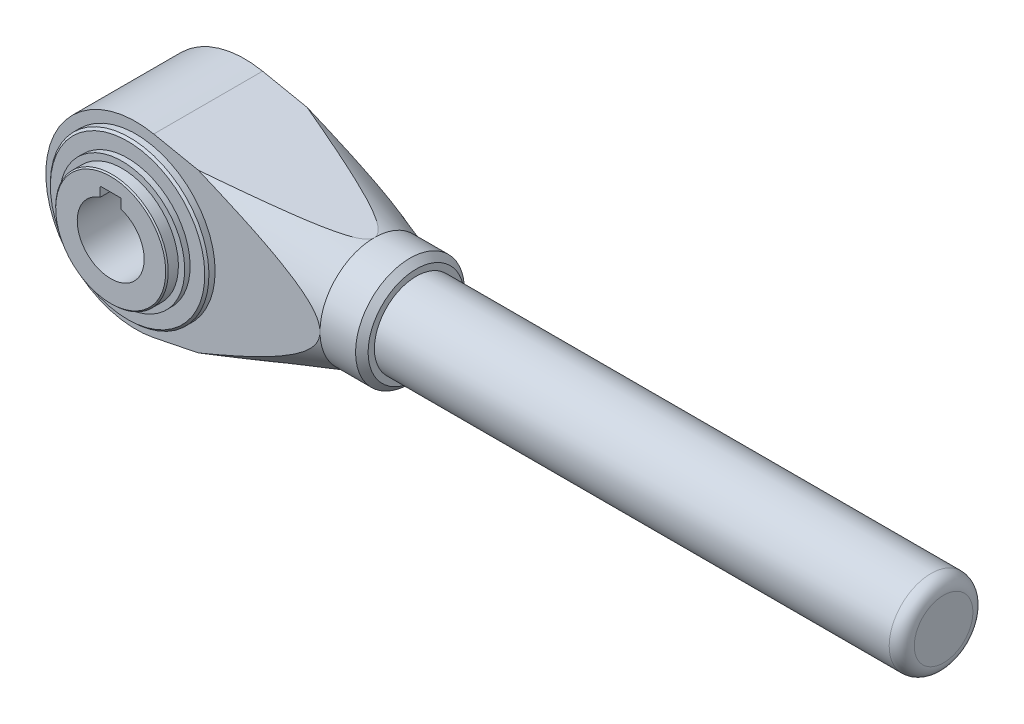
ISO-10303-21;
HEADER;
FILE_DESCRIPTION(('STEP AP214'),'2;1');
FILE_NAME('part.step','',(''),(''),'','','');
FILE_SCHEMA(('AUTOMOTIVE_DESIGN { 1 0 10303 214 1 1 1 1 }'));
ENDSEC;
DATA;
#1=APPLICATION_CONTEXT('core data for automotive mechanical design processes');
#2=APPLICATION_PROTOCOL_DEFINITION('international standard','automotive_design',2000,#1);
#3=PRODUCT_CONTEXT('',#1,'mechanical');
#4=PRODUCT('Part','Part','',(#3));
#5=PRODUCT_RELATED_PRODUCT_CATEGORY('part','',(#4));
#6=PRODUCT_DEFINITION_FORMATION('','',#4);
#7=PRODUCT_DEFINITION_CONTEXT('part definition',#1,'design');
#8=PRODUCT_DEFINITION('design','',#6,#7);
#9=PRODUCT_DEFINITION_SHAPE('','',#8);
#10=(LENGTH_UNIT() NAMED_UNIT(*) SI_UNIT(.MILLI.,.METRE.));
#11=(NAMED_UNIT(*) PLANE_ANGLE_UNIT() SI_UNIT($,.RADIAN.));
#12=(NAMED_UNIT(*) SI_UNIT($,.STERADIAN.) SOLID_ANGLE_UNIT());
#13=UNCERTAINTY_MEASURE_WITH_UNIT(LENGTH_MEASURE(1.E-05),#10,'distance_accuracy_value','');
#14=(GEOMETRIC_REPRESENTATION_CONTEXT(3) GLOBAL_UNCERTAINTY_ASSIGNED_CONTEXT((#13)) GLOBAL_UNIT_ASSIGNED_CONTEXT((#10,
#11,#12)) REPRESENTATION_CONTEXT('',''));
#15=CARTESIAN_POINT('',(0.,0.,0.));
#16=DIRECTION('',(0.,0.,1.));
#17=DIRECTION('',(1.,0.,0.));
#18=AXIS2_PLACEMENT_3D('',#15,#16,#17);
#19=CARTESIAN_POINT('',(0.,0.,32.));
#20=DIRECTION('',(0.,0.,1.));
#21=DIRECTION('',(1.,0.,0.));
#22=AXIS2_PLACEMENT_3D('',#19,#20,#21);
#23=PLANE('',#22);
#24=CARTESIAN_POINT('',(0.,-1.49880108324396E-12,32.));
#25=DIRECTION('',(0.,0.,1.));
#26=DIRECTION('',(1.,0.,0.));
#27=AXIS2_PLACEMENT_3D('',#24,#25,#26);
#28=CIRCLE('',#27,18.9471944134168);
#29=CARTESIAN_POINT('',(18.9471944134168,-1.49880108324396E-12,32.));
#30=VERTEX_POINT('',#29);
#31=EDGE_CURVE('E379',#30,#30,#28,.F.);
#32=ORIENTED_EDGE('',*,*,#31,.T.);
#33=EDGE_LOOP('',(#32));
#34=FACE_BOUND('',#33,.T.);
#35=DIRECTION('',(-0.979979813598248,-0.199096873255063,0.));
#36=VECTOR('',#35,1.);
#37=CARTESIAN_POINT('',(44.,-13.,32.));
#38=LINE('',#37,#36);
#39=CARTESIAN_POINT('',(14.9226502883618,-18.9074782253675,32.));
#40=VERTEX_POINT('',#39);
#41=CARTESIAN_POINT('',(4.28058277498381,-21.0695659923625,32.));
#42=VERTEX_POINT('',#41);
#43=EDGE_CURVE('E386',#40,#42,#38,.T.);
#44=ORIENTED_EDGE('',*,*,#43,.F.);
#45=CARTESIAN_POINT('',(-15.1513562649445,-30.5834782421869,32.));
#46=CARTESIAN_POINT('',(-13.8278855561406,-30.0915861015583,32.));
#47=CARTESIAN_POINT('',(-12.5049915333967,-29.5981370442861,32.));
#48=CARTESIAN_POINT('',(-9.8605812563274,-28.6075375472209,32.));
#49=CARTESIAN_POINT('',(-8.53906501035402,-28.1103870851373,32.));
#50=CARTESIAN_POINT('',(-5.89738694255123,-27.1117034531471,32.));
#51=CARTESIAN_POINT('',(-4.57722544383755,-26.6101694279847,32.));
#52=CARTESIAN_POINT('',(-1.93883263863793,-25.6020549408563,32.));
#53=CARTESIAN_POINT('',(-0.620601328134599,-25.0954744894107,32.));
#54=CARTESIAN_POINT('',(2.01444610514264,-24.0759646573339,32.));
#55=CARTESIAN_POINT('',(3.33126063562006,-23.5630311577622,32.));
#56=CARTESIAN_POINT('',(5.96204893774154,-22.5299323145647,32.));
#57=CARTESIAN_POINT('',(7.27602271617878,-22.0097669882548,32.));
#58=CARTESIAN_POINT('',(9.90032474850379,-20.9606508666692,32.));
#59=CARTESIAN_POINT('',(11.2106533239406,-20.4317008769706,32.));
#60=CARTESIAN_POINT('',(13.8268183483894,-19.3628280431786,32.));
#61=CARTESIAN_POINT('',(15.1326548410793,-18.8229053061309,32.));
#62=CARTESIAN_POINT('',(17.7379007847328,-17.7294067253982,32.));
#63=CARTESIAN_POINT('',(19.0373129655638,-17.1758374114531,32.));
#64=CARTESIAN_POINT('',(20.9805869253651,-16.3318456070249,32.));
#65=CARTESIAN_POINT('',(21.6274046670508,-16.0482267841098,32.));
#66=CARTESIAN_POINT('',(22.9187061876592,-15.4757213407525,32.));
#67=CARTESIAN_POINT('',(23.5631899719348,-15.186834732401,32.));
#68=CARTESIAN_POINT('',(24.8500959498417,-14.6025995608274,32.));
#69=CARTESIAN_POINT('',(25.4925150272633,-14.3072441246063,32.));
#70=CARTESIAN_POINT('',(26.7739701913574,-13.7092861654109,32.));
#71=CARTESIAN_POINT('',(27.4130063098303,-13.4066837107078,32.));
#72=CARTESIAN_POINT('',(28.6868082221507,-12.7928783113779,32.));
#73=CARTESIAN_POINT('',(29.3215747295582,-12.4816768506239,32.));
#74=CARTESIAN_POINT('',(30.5858577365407,-11.8488072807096,32.));
#75=CARTESIAN_POINT('',(31.2153744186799,-11.5271395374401,32.));
#76=CARTESIAN_POINT('',(32.4693462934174,-10.8700006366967,32.));
#77=CARTESIAN_POINT('',(33.0937832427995,-10.5344945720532,32.));
#78=CARTESIAN_POINT('',(34.3337984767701,-9.84705401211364,32.));
#79=CARTESIAN_POINT('',(34.9493748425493,-9.4951160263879,32.));
#80=CARTESIAN_POINT('',(35.8625340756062,-8.95175218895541,32.));
#81=CARTESIAN_POINT('',(36.1648573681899,-8.76828771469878,32.));
#82=CARTESIAN_POINT('',(36.765711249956,-8.39526006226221,32.));
#83=CARTESIAN_POINT('',(37.0642420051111,-8.20569715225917,32.));
#84=CARTESIAN_POINT('',(37.6565906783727,-7.81956200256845,32.));
#85=CARTESIAN_POINT('',(37.9504102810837,-7.62299235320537,32.));
#86=CARTESIAN_POINT('',(38.532321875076,-7.22157612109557,32.));
#87=CARTESIAN_POINT('',(38.8204144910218,-7.01673044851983,32.));
#88=CARTESIAN_POINT('',(39.3112129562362,-6.65483629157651,32.));
#89=CARTESIAN_POINT('',(39.5156343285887,-6.50011623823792,32.));
#90=CARTESIAN_POINT('',(39.9198971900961,-6.18477481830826,32.));
#91=CARTESIAN_POINT('',(40.1197385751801,-6.02415331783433,32.));
#92=CARTESIAN_POINT('',(40.514304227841,-5.69576293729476,32.));
#93=CARTESIAN_POINT('',(40.7090148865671,-5.52797764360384,32.));
#94=CARTESIAN_POINT('',(41.0914549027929,-5.18461128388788,32.));
#95=CARTESIAN_POINT('',(41.2791845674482,-5.00903056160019,32.));
#96=CARTESIAN_POINT('',(41.6477351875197,-4.64701980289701,32.));
#97=CARTESIAN_POINT('',(41.8284656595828,-4.46049704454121,32.));
#98=CARTESIAN_POINT('',(42.17845517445,-4.07678637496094,32.));
#99=CARTESIAN_POINT('',(42.3477103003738,-3.8795948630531,32.));
#100=CARTESIAN_POINT('',(42.6706218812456,-3.47371994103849,32.));
#101=CARTESIAN_POINT('',(42.8243267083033,-3.26507549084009,32.));
#102=CARTESIAN_POINT('',(43.1117654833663,-2.83463511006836,32.));
#103=CARTESIAN_POINT('',(43.245519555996,-2.61285275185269,32.));
#104=CARTESIAN_POINT('',(43.4964087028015,-2.13700880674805,32.));
#105=CARTESIAN_POINT('',(43.611408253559,-1.88178043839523,32.));
#106=CARTESIAN_POINT('',(43.7536560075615,-1.48821370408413,32.));
#107=CARTESIAN_POINT('',(43.7960233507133,-1.35527115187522,32.));
#108=CARTESIAN_POINT('',(43.8695295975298,-1.08634216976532,32.));
#109=CARTESIAN_POINT('',(43.900673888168,-0.95035723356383,32.));
#110=CARTESIAN_POINT('',(43.9509786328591,-0.674772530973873,32.));
#111=CARTESIAN_POINT('',(43.9700168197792,-0.535150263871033,32.));
#112=CARTESIAN_POINT('',(43.9949121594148,-0.25472828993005,32.));
#113=CARTESIAN_POINT('',(44.000769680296,-0.11392861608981,32.));
#114=CARTESIAN_POINT('',(43.9990681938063,0.167627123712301,32.));
#115=CARTESIAN_POINT('',(43.9915060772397,0.308383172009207,32.));
#116=CARTESIAN_POINT('',(43.9632763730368,0.58853767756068,32.));
#117=CARTESIAN_POINT('',(43.9426088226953,0.727936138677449,32.));
#118=CARTESIAN_POINT('',(43.8673292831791,1.11505981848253,32.));
#119=CARTESIAN_POINT('',(43.798788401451,1.36015507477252,32.));
#120=CARTESIAN_POINT('',(43.6282573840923,1.83809788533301,32.));
#121=CARTESIAN_POINT('',(43.5262529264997,2.07094014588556,32.));
#122=CARTESIAN_POINT('',(43.3049010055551,2.50605752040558,32.));
#123=CARTESIAN_POINT('',(43.1874448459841,2.70931313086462,32.));
#124=CARTESIAN_POINT('',(42.935116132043,3.10480804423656,32.));
#125=CARTESIAN_POINT('',(42.8002292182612,3.29703807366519,32.));
#126=CARTESIAN_POINT('',(42.5165321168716,3.67186992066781,32.));
#127=CARTESIAN_POINT('',(42.3676757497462,3.85443644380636,32.));
#128=CARTESIAN_POINT('',(42.0594488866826,4.21027933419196,32.));
#129=CARTESIAN_POINT('',(41.9000819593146,4.38355881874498,32.));
#130=CARTESIAN_POINT('',(41.4815190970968,4.81671565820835,32.));
#131=CARTESIAN_POINT('',(41.2163509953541,5.07080940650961,32.));
#132=CARTESIAN_POINT('',(40.6715209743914,5.56305926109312,32.));
#133=CARTESIAN_POINT('',(40.3918503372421,5.8012055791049,32.));
#134=CARTESIAN_POINT('',(39.8212595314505,6.26483041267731,32.));
#135=CARTESIAN_POINT('',(39.5303164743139,6.49028059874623,32.));
#136=CARTESIAN_POINT('',(38.9403830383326,6.93018924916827,32.));
#137=CARTESIAN_POINT('',(38.6413944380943,7.14465011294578,32.));
#138=CARTESIAN_POINT('',(38.0351562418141,7.56575815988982,32.));
#139=CARTESIAN_POINT('',(37.7278661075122,7.77234675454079,32.));
#140=CARTESIAN_POINT('',(37.1081602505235,8.17769317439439,32.));
#141=CARTESIAN_POINT('',(36.7957442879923,8.37645063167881,32.));
#142=CARTESIAN_POINT('',(36.1671913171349,8.76699425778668,32.));
#143=CARTESIAN_POINT('',(35.8510600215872,8.95878964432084,32.));
#144=CARTESIAN_POINT('',(35.2153865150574,9.33660099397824,32.));
#145=CARTESIAN_POINT('',(34.8958444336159,9.52261717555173,32.));
#146=CARTESIAN_POINT('',(34.2002889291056,9.92027290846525,32.));
#147=CARTESIAN_POINT('',(33.8237565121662,10.1310037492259,32.));
#148=CARTESIAN_POINT('',(33.0674563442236,10.5465846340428,32.));
#149=CARTESIAN_POINT('',(32.6876885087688,10.7514345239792,32.));
#150=CARTESIAN_POINT('',(31.5442589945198,11.3584076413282,32.));
#151=CARTESIAN_POINT('',(30.7765493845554,11.7529101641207,32.));
#152=CARTESIAN_POINT('',(29.2329928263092,12.5264312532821,32.));
#153=CARTESIAN_POINT('',(28.4571423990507,12.9054428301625,32.));
#154=CARTESIAN_POINT('',(26.8994815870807,13.6510422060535,32.));
#155=CARTESIAN_POINT('',(26.117671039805,14.0176296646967,32.));
#156=CARTESIAN_POINT('',(24.547904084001,14.741437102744,32.));
#157=CARTESIAN_POINT('',(23.759938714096,15.0986375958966,32.));
#158=CARTESIAN_POINT('',(22.1802831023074,15.8047172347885,32.));
#159=CARTESIAN_POINT('',(21.3885928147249,16.153596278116,32.));
#160=CARTESIAN_POINT('',(19.802404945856,16.8442988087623,32.));
#161=CARTESIAN_POINT('',(19.0079082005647,17.1861242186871,32.));
#162=CARTESIAN_POINT('',(17.4164063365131,17.8638872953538,32.));
#163=CARTESIAN_POINT('',(16.6194012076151,18.1998249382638,32.));
#164=CARTESIAN_POINT('',(15.0253153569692,18.8658153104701,32.));
#165=CARTESIAN_POINT('',(14.2282399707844,19.1958808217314,32.));
#166=CARTESIAN_POINT('',(12.6323070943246,19.8516773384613,32.));
#167=CARTESIAN_POINT('',(11.8334495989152,20.177408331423,32.));
#168=CARTESIAN_POINT('',(9.43449709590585,21.1490020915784,32.));
#169=CARTESIAN_POINT('',(7.83211756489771,21.7892259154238,32.));
#170=CARTESIAN_POINT('',(4.62454583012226,23.0573480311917,32.));
#171=CARTESIAN_POINT('',(3.01935868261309,23.6852591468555,32.));
#172=CARTESIAN_POINT('',(-0.194554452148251,24.9318462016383,32.));
#173=CARTESIAN_POINT('',(-1.80328036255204,25.5505223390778,32.));
#174=CARTESIAN_POINT('',(-5.41050799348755,26.9282081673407,32.));
#175=CARTESIAN_POINT('',(-7.40977459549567,27.6852135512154,32.));
#176=CARTESIAN_POINT('',(-11.4116898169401,29.1902386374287,32.));
#177=CARTESIAN_POINT('',(-13.4143384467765,29.9382583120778,32.));
#178=CARTESIAN_POINT('',(-17.4223462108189,31.4271002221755,32.));
#179=CARTESIAN_POINT('',(-19.4277053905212,32.1679223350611,32.));
#180=CARTESIAN_POINT('',(-23.4405853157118,33.6436897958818,32.));
#181=CARTESIAN_POINT('',(-25.448106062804,34.3786351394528,32.));
#182=CARTESIAN_POINT('',(-29.4659545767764,35.8440450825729,32.));
#183=CARTESIAN_POINT('',(-31.4762832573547,36.5745071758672,32.));
#184=CARTESIAN_POINT('',(-35.4984169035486,38.0313552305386,32.));
#185=CARTESIAN_POINT('',(-37.5102218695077,38.7577411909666,32.));
#186=CARTESIAN_POINT('',(-43.5474529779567,40.9317459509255,32.));
#187=CARTESIAN_POINT('',(-47.5747302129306,42.3742243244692,32.));
#188=CARTESIAN_POINT('',(-55.6126699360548,45.2419293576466,32.));
#189=CARTESIAN_POINT('',(-59.623314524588,46.6672062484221,32.));
#190=CARTESIAN_POINT('',(-67.6472968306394,49.5101913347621,32.));
#191=CARTESIAN_POINT('',(-71.6606345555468,50.9278995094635,32.));
#192=CARTESIAN_POINT('',(-79.686931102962,53.7565629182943,32.));
#193=CARTESIAN_POINT('',(-83.6998886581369,55.1675217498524,32.));
#194=CARTESIAN_POINT('',(-89.7205471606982,57.2804498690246,32.));
#195=CARTESIAN_POINT('',(-91.7276329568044,57.9841727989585,32.));
#196=CARTESIAN_POINT('',(-95.742173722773,59.3905641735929,32.));
#197=CARTESIAN_POINT('',(-97.7496286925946,60.0932326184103,32.));
#198=CARTESIAN_POINT('',(-99.7572480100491,60.7954311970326,32.));
#199=B_SPLINE_CURVE_WITH_KNOTS('',3,(#45,#46,#47,#48,#49,#50,#51,#52,#53,#54,#55,#56,#57,#58,
#59,#60,#61,#62,#63,#64,#65,#66,#67,#68,#69,#70,#71,#72,#73,#74,#75,#76,#77,#78,#79,#80,#81,#82,
#83,#84,#85,#86,#87,#88,#89,#90,#91,#92,#93,#94,#95,#96,#97,#98,#99,#100,#101,#102,#103,#104,
#105,#106,#107,#108,#109,#110,#111,#112,#113,#114,#115,#116,#117,#118,#119,#120,#121,#122,#123,
#124,#125,#126,#127,#128,#129,#130,#131,#132,#133,#134,#135,#136,#137,#138,#139,#140,#141,#142,
#143,#144,#145,#146,#147,#148,#149,#150,#151,#152,#153,#154,#155,#156,#157,#158,#159,#160,#161,
#162,#163,#164,#165,#166,#167,#168,#169,#170,#171,#172,#173,#174,#175,#176,#177,#178,#179,#180,
#181,#182,#183,#184,#185,#186,#187,#188,#189,#190,#191,#192,#193,#194,#195,#196,#197,#198),
.UNSPECIFIED.,.F.,.F.,(4,2,2,2,2,2,2,2,2,2,2,2,2,2,2,2,2,2,2,2,2,2,2,2,2,2,2,2,2,2,2,2,2,2,2,2,
2,2,2,2,2,2,2,2,2,2,2,2,2,2,2,2,2,2,2,2,2,2,2,2,2,2,2,2,2,2,2,2,2,2,2,2,2,2,2,2,4),(0.,
4.23577718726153,8.47157990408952,12.7082283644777,16.9448679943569,21.1844154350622,
25.4239527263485,29.663103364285,33.9022126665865,38.1393315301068,40.2581134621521,
42.3768905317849,44.4980398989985,46.61916929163,48.7399349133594,50.8606264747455,
52.9870408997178,55.1139090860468,56.1747607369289,57.2355658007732,58.2959826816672,
59.3562832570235,60.1253086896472,60.8943515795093,61.6652625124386,62.4361394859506,
63.2149140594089,63.9939531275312,64.7704890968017,65.5462363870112,66.3830180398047,
66.8012049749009,67.2191909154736,67.6413339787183,68.0634652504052,68.485694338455,
68.9079222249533,69.668213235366,70.4288300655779,71.1320097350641,71.8357724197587,
72.5419495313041,73.2478881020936,74.3487444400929,75.4502703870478,76.5541640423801,
77.657815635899,78.7685093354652,79.8792551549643,80.9884723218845,82.0976475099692,
83.3920551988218,84.6864967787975,87.2756489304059,89.8659566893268,92.4563353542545,
95.0517234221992,97.6471434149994,100.241846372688,102.8365598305,105.424681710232,
108.012811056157,113.189380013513,118.360235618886,123.530980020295,129.944305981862,
136.357651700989,142.771106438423,149.184565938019,155.601332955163,162.018101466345,
174.851527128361,187.620627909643,200.389763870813,213.151096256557,219.531736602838,
225.912376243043),.UNSPECIFIED.);
#200=CARTESIAN_POINT('',(44.,0.,32.));
#201=VERTEX_POINT('',#200);
#202=EDGE_CURVE('E225',#40,#201,#199,.T.);
#203=ORIENTED_EDGE('',*,*,#202,.T.);
#204=CARTESIAN_POINT('',(14.9226502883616,18.9074782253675,32.));
#205=VERTEX_POINT('',#204);
#206=EDGE_CURVE('E217',#201,#205,#199,.T.);
#207=ORIENTED_EDGE('',*,*,#206,.T.);
#208=DIRECTION('',(-0.979979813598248,0.199096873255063,0.));
#209=VECTOR('',#208,1.);
#210=CARTESIAN_POINT('',(44.,13.,32.));
#211=LINE('',#210,#209);
#212=CARTESIAN_POINT('',(4.28058277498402,21.0695659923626,32.));
#213=VERTEX_POINT('',#212);
#214=EDGE_CURVE('E393',#205,#213,#211,.T.);
#215=ORIENTED_EDGE('',*,*,#214,.T.);
#216=CARTESIAN_POINT('',(0.,0.,32.));
#217=DIRECTION('',(0.,0.,1.));
#218=DIRECTION('',(1.,0.,0.));
#219=AXIS2_PLACEMENT_3D('',#216,#217,#218);
#220=CIRCLE('',#219,21.5);
#221=EDGE_CURVE('E389',#213,#42,#220,.T.);
#222=ORIENTED_EDGE('',*,*,#221,.T.);
#223=EDGE_LOOP('',(#44,#203,#207,#215,#222));
#224=FACE_BOUND('',#223,.T.);
#225=ADVANCED_FACE('F15',(#34,#224),#23,.T.);
#226=CARTESIAN_POINT('',(44.,13.,32.));
#227=DIRECTION('',(-0.199096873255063,-0.979979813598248,0.));
#228=DIRECTION('',(0.979979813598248,-0.199096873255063,0.));
#229=AXIS2_PLACEMENT_3D('',#226,#227,#228);
#230=PLANE('',#229);
#231=CARTESIAN_POINT('',(14.9220013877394,18.9076100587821,5.9998));
#232=CARTESIAN_POINT('',(15.6006250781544,18.76973797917,6.20897415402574));
#233=CARTESIAN_POINT('',(16.2789789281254,18.6319207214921,6.41906406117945));
#234=CARTESIAN_POINT('',(17.635040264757,18.3564175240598,6.84142367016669));
#235=CARTESIAN_POINT('',(18.3127477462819,18.2187315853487,7.05369338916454));
#236=CARTESIAN_POINT('',(19.6676080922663,17.9434723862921,7.48082355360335));
#237=CARTESIAN_POINT('',(20.3447607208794,17.805899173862,7.69568477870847));
#238=CARTESIAN_POINT('',(21.698149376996,17.5309389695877,8.12838814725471));
#239=CARTESIAN_POINT('',(22.3743854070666,17.3935519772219,8.34623028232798));
#240=CARTESIAN_POINT('',(23.7237979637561,17.1193995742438,8.78483376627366));
#241=CARTESIAN_POINT('',(24.3969776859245,16.98263351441,9.00558486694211));
#242=CARTESIAN_POINT('',(25.7419786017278,16.7093773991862,9.45135401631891));
#243=CARTESIAN_POINT('',(26.4137997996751,16.57288734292,9.67637205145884));
#244=CARTESIAN_POINT('',(27.75562875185,16.3002756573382,10.1316095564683));
#245=CARTESIAN_POINT('',(28.4256367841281,16.1641539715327,10.3618281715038));
#246=CARTESIAN_POINT('',(29.7634537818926,15.8923573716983,10.8288144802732));
#247=CARTESIAN_POINT('',(30.4312627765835,15.7566824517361,11.0655820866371));
#248=CARTESIAN_POINT('',(31.7642471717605,15.4858676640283,11.5476232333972));
#249=CARTESIAN_POINT('',(32.429421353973,15.3507280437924,11.7929002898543));
#250=CARTESIAN_POINT('',(33.7559256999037,15.0812297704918,12.2946072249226));
#251=CARTESIAN_POINT('',(34.4172549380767,14.9468713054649,12.5510396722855));
#252=CARTESIAN_POINT('',(35.4061527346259,14.7459626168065,12.94774663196));
#253=CARTESIAN_POINT('',(35.7359337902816,14.6789628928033,13.0822766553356));
#254=CARTESIAN_POINT('',(36.3936237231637,14.5453438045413,13.3560124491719));
#255=CARTESIAN_POINT('',(36.7215326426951,14.4787244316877,13.4952181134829));
#256=CARTESIAN_POINT('',(37.3748219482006,14.3459993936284,13.7792563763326));
#257=CARTESIAN_POINT('',(37.7002034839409,14.2798934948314,13.9240862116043));
#258=CARTESIAN_POINT('',(38.3478386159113,14.1483171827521,14.2208227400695));
#259=CARTESIAN_POINT('',(38.6700924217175,14.0828467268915,14.372728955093));
#260=CARTESIAN_POINT('',(39.3123174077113,13.9523695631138,14.6865304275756));
#261=CARTESIAN_POINT('',(39.6322631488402,13.8873680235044,14.8484803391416));
#262=CARTESIAN_POINT('',(40.2663287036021,13.7585485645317,15.1846470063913));
#263=CARTESIAN_POINT('',(40.5804426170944,13.6947318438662,15.3588754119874));
#264=CARTESIAN_POINT('',(41.1978086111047,13.5693051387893,15.72308246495));
#265=CARTESIAN_POINT('',(41.5011091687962,13.5076853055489,15.9129733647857));
#266=CARTESIAN_POINT('',(41.9439770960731,13.4177103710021,16.2157742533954));
#267=CARTESIAN_POINT('',(42.0894808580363,13.3881492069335,16.3196170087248));
#268=CARTESIAN_POINT('',(42.3750238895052,13.3301370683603,16.5348119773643));
#269=CARTESIAN_POINT('',(42.5150656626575,13.3016855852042,16.6461606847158));
#270=CARTESIAN_POINT('',(42.7279258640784,13.2584399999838,16.8276108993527));
#271=CARTESIAN_POINT('',(42.8033818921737,13.2431100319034,16.8944779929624));
#272=CARTESIAN_POINT('',(42.9512114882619,13.2130763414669,17.0316708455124));
#273=CARTESIAN_POINT('',(43.0235844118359,13.1983727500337,17.101997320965));
#274=CARTESIAN_POINT('',(43.2348909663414,13.1554428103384,17.3188260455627));
#275=CARTESIAN_POINT('',(43.3682145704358,13.1283562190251,17.471344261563));
#276=CARTESIAN_POINT('',(43.5694080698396,13.0874808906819,17.742994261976));
#277=CARTESIAN_POINT('',(43.6443768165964,13.0722499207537,17.8565884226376));
#278=CARTESIAN_POINT('',(43.7773675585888,13.0452309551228,18.0937730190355));
#279=CARTESIAN_POINT('',(43.8354215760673,13.0334364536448,18.217343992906));
#280=CARTESIAN_POINT('',(43.9172753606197,13.0168066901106,18.4442551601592));
#281=CARTESIAN_POINT('',(43.9458718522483,13.0109969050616,18.5457626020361));
#282=CARTESIAN_POINT('',(43.9859281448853,13.0028588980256,18.7522128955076));
#283=CARTESIAN_POINT('',(43.9974122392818,13.0005257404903,18.8571506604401));
#284=CARTESIAN_POINT('',(44.0018062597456,12.9996330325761,19.0677263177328));
#285=CARTESIAN_POINT('',(43.9946665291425,13.0010835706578,19.1733653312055));
#286=CARTESIAN_POINT('',(43.9626651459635,13.0075851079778,19.3818415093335));
#287=CARTESIAN_POINT('',(43.937780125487,13.0126408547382,19.4846747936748));
#288=CARTESIAN_POINT('',(43.8624051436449,13.0279543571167,19.7182442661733));
#289=CARTESIAN_POINT('',(43.8061826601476,13.0393767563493,19.8470207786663));
#290=CARTESIAN_POINT('',(43.6748825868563,13.0660522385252,20.0940414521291));
#291=CARTESIAN_POINT('',(43.5997632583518,13.0813138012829,20.2122615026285));
#292=CARTESIAN_POINT('',(43.4412152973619,13.1135250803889,20.4325377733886));
#293=CARTESIAN_POINT('',(43.3584830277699,13.1303333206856,20.5351276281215));
#294=CARTESIAN_POINT('',(43.1848109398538,13.1656172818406,20.7328732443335));
#295=CARTESIAN_POINT('',(43.0938630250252,13.1840946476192,20.828021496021));
#296=CARTESIAN_POINT('',(42.9057563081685,13.2223112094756,21.0123061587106));
#297=CARTESIAN_POINT('',(42.8085773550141,13.2420544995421,21.1014209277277));
#298=CARTESIAN_POINT('',(42.6098476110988,13.2824292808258,21.2742686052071));
#299=CARTESIAN_POINT('',(42.5082990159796,13.303060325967,21.3580041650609));
#300=CARTESIAN_POINT('',(42.2056373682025,13.3645503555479,21.5970002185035));
#301=CARTESIAN_POINT('',(41.9999321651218,13.4063423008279,21.7461925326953));
#302=CARTESIAN_POINT('',(41.5805383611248,13.4915481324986,22.0324865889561));
#303=CARTESIAN_POINT('',(41.3668439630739,13.5349631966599,22.1695792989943));
#304=CARTESIAN_POINT('',(40.933548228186,13.6229934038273,22.4347789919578));
#305=CARTESIAN_POINT('',(40.7139347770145,13.6676110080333,22.562865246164));
#306=CARTESIAN_POINT('',(40.2707709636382,13.7576460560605,22.8117498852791));
#307=CARTESIAN_POINT('',(40.0472201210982,13.8030635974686,22.9325473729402));
#308=CARTESIAN_POINT('',(39.5951393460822,13.8949102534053,23.1693454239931));
#309=CARTESIAN_POINT('',(39.3665826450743,13.9413448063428,23.2852925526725));
#310=CARTESIAN_POINT('',(38.9071426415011,14.0346865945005,23.5123051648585));
#311=CARTESIAN_POINT('',(38.6762591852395,14.0815938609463,23.6233703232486));
#312=CARTESIAN_POINT('',(38.2130207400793,14.1757073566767,23.8412575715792));
#313=CARTESIAN_POINT('',(37.980668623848,14.2229130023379,23.9480860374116));
#314=CARTESIAN_POINT('',(37.5144871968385,14.3176244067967,24.1583019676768));
#315=CARTESIAN_POINT('',(37.2806579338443,14.3651301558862,24.2616895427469));
#316=CARTESIAN_POINT('',(36.5827294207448,14.5069242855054,24.5651207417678));
#317=CARTESIAN_POINT('',(36.1168535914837,14.6015736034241,24.7609107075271));
#318=CARTESIAN_POINT('',(35.1816951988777,14.7915643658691,25.1438512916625));
#319=CARTESIAN_POINT('',(34.7124124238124,14.8869058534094,25.3310013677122));
#320=CARTESIAN_POINT('',(33.7712131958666,15.0781238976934,25.698552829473));
#321=CARTESIAN_POINT('',(33.2992962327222,15.1740005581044,25.8789528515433));
#322=CARTESIAN_POINT('',(32.3534905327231,15.3661544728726,26.2342967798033));
#323=CARTESIAN_POINT('',(31.8796017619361,15.4624317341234,26.4092405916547));
#324=CARTESIAN_POINT('',(30.4540876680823,15.7520452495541,26.9279793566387));
#325=CARTESIAN_POINT('',(29.5001302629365,15.9458552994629,27.265097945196));
#326=CARTESIAN_POINT('',(27.588226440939,16.3342858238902,27.9268655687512));
#327=CARTESIAN_POINT('',(26.6302805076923,16.5289062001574,28.2515160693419));
#328=CARTESIAN_POINT('',(24.7775956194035,16.9053055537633,28.8695572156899));
#329=CARTESIAN_POINT('',(23.8830523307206,17.0870447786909,29.1635598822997));
#330=CARTESIAN_POINT('',(22.0920043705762,17.4509217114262,29.745385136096));
#331=CARTESIAN_POINT('',(21.1954996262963,17.633059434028,30.0332074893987));
#332=CARTESIAN_POINT('',(19.4034793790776,17.9971339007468,30.6031513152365));
#333=CARTESIAN_POINT('',(18.5079680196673,18.179069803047,30.8852863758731));
#334=CARTESIAN_POINT('',(16.7157911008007,18.5431760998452,31.4455355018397));
#335=CARTESIAN_POINT('',(15.8191256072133,18.725346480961,31.7236497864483));
#336=CARTESIAN_POINT('',(14.9220013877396,18.9076100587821,32.0002));
#337=B_SPLINE_CURVE_WITH_KNOTS('',3,(#231,#232,#233,#234,#235,#236,#237,#238,#239,#240,#241,
#242,#243,#244,#245,#246,#247,#248,#249,#250,#251,#252,#253,#254,#255,#256,#257,#258,#259,#260,
#261,#262,#263,#264,#265,#266,#267,#268,#269,#270,#271,#272,#273,#274,#275,#276,#277,#278,#279,
#280,#281,#282,#283,#284,#285,#286,#287,#288,#289,#290,#291,#292,#293,#294,#295,#296,#297,#298,
#299,#300,#301,#302,#303,#304,#305,#306,#307,#308,#309,#310,#311,#312,#313,#314,#315,#316,#317,
#318,#319,#320,#321,#322,#323,#324,#325,#326,#327,#328,#329,#330,#331,#332,#333,#334,#335,#336),
.UNSPECIFIED.,.F.,.F.,(4,2,2,2,2,2,2,2,2,2,2,2,2,2,2,2,2,2,2,2,2,2,2,2,2,2,2,2,2,2,2,2,2,2,2,2,
2,2,2,2,2,2,2,2,2,2,2,2,2,2,2,2,4),(0.,2.17017024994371,4.34035760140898,6.51121500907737,
8.68206632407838,10.8466479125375,13.0112226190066,15.1754440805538,17.339636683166,
19.5047344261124,21.6703333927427,22.7575438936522,23.8447297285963,24.9313880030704,
26.0179729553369,27.1111025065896,28.2052835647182,29.2937042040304,29.8370965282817,
30.380236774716,30.6860703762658,30.9919675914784,31.6029690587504,32.0128321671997,
32.4219142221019,32.7374807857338,33.0525989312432,33.3685581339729,33.6849341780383,
34.1054691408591,34.5269412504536,34.9249252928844,35.3233059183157,35.7230471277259,
36.122589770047,36.8944811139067,37.6669438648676,38.441129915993,39.2154110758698,
39.9967137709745,40.7780684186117,41.5581987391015,42.3383039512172,43.8805732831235,
45.422939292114,46.9656152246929,48.5083178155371,51.5986815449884,54.6886808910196,
57.5656420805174,60.442711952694,63.3118087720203,66.1807485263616),.UNSPECIFIED.);
#338=CARTESIAN_POINT('',(14.9226502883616,18.9074782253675,6.));
#339=VERTEX_POINT('',#338);
#340=CARTESIAN_POINT('',(44.,13.,19.));
#341=VERTEX_POINT('',#340);
#342=EDGE_CURVE('E189',#339,#341,#337,.T.);
#343=ORIENTED_EDGE('',*,*,#342,.F.);
#344=DIRECTION('',(-0.979979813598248,0.199096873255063,0.));
#345=VECTOR('',#344,1.);
#346=CARTESIAN_POINT('',(44.,13.,6.));
#347=LINE('',#346,#345);
#348=CARTESIAN_POINT('',(4.28058277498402,21.0695659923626,6.));
#349=VERTEX_POINT('',#348);
#350=EDGE_CURVE('E383',#339,#349,#347,.T.);
#351=ORIENTED_EDGE('',*,*,#350,.T.);
#352=DIRECTION('',(0.,0.,-1.));
#353=VECTOR('',#352,1.);
#354=CARTESIAN_POINT('',(4.28058277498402,21.0695659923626,32.));
#355=LINE('',#354,#353);
#356=EDGE_CURVE('E400',#213,#349,#355,.T.);
#357=ORIENTED_EDGE('',*,*,#356,.F.);
#358=ORIENTED_EDGE('',*,*,#214,.F.);
#359=EDGE_CURVE('E226',#341,#205,#337,.T.);
#360=ORIENTED_EDGE('',*,*,#359,.F.);
#361=EDGE_LOOP('',(#343,#351,#357,#358,#360));
#362=FACE_BOUND('',#361,.T.);
#363=ADVANCED_FACE('F231',(#362),#230,.F.);
#364=CARTESIAN_POINT('',(44.,-13.,32.));
#365=DIRECTION('',(0.199096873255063,-0.979979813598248,0.));
#366=DIRECTION('',(0.979979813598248,0.199096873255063,0.));
#367=AXIS2_PLACEMENT_3D('',#364,#365,#366);
#368=PLANE('',#367);
#369=DIRECTION('',(-0.979979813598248,-0.199096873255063,0.));
#370=VECTOR('',#369,1.);
#371=CARTESIAN_POINT('',(44.,-13.,6.));
#372=LINE('',#371,#370);
#373=CARTESIAN_POINT('',(14.9226502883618,-18.9074782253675,6.));
#374=VERTEX_POINT('',#373);
#375=CARTESIAN_POINT('',(4.28058277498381,-21.0695659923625,6.));
#376=VERTEX_POINT('',#375);
#377=EDGE_CURVE('E375',#374,#376,#372,.T.);
#378=ORIENTED_EDGE('',*,*,#377,.F.);
#379=CARTESIAN_POINT('',(14.9220013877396,-18.907610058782,5.9998));
#380=CARTESIAN_POINT('',(15.6006250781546,-18.76973797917,6.20897415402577));
#381=CARTESIAN_POINT('',(16.2789789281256,-18.6319207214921,6.41906406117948));
#382=CARTESIAN_POINT('',(17.6350402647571,-18.3564175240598,6.84142367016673));
#383=CARTESIAN_POINT('',(18.312747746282,-18.2187315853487,7.05369338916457));
#384=CARTESIAN_POINT('',(19.6676080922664,-17.943472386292,7.48082355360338));
#385=CARTESIAN_POINT('',(20.3447607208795,-17.805899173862,7.69568477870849));
#386=CARTESIAN_POINT('',(21.698149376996,-17.5309389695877,8.12838814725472));
#387=CARTESIAN_POINT('',(22.3743854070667,-17.3935519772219,8.34623028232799));
#388=CARTESIAN_POINT('',(23.7237979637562,-17.1193995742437,8.78483376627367));
#389=CARTESIAN_POINT('',(24.3969776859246,-16.98263351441,9.00558486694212));
#390=CARTESIAN_POINT('',(25.7419786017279,-16.7093773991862,9.45135401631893));
#391=CARTESIAN_POINT('',(26.4137997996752,-16.57288734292,9.67637205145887));
#392=CARTESIAN_POINT('',(27.7556287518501,-16.3002756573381,10.1316095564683));
#393=CARTESIAN_POINT('',(28.4256367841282,-16.1641539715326,10.3618281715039));
#394=CARTESIAN_POINT('',(29.7634537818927,-15.8923573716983,10.8288144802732));
#395=CARTESIAN_POINT('',(30.4312627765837,-15.7566824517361,11.0655820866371));
#396=CARTESIAN_POINT('',(31.7642471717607,-15.4858676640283,11.5476232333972));
#397=CARTESIAN_POINT('',(32.4294213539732,-15.3507280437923,11.7929002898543));
#398=CARTESIAN_POINT('',(33.7559256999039,-15.0812297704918,12.2946072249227));
#399=CARTESIAN_POINT('',(34.4172549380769,-14.9468713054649,12.5510396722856));
#400=CARTESIAN_POINT('',(35.4061527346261,-14.7459626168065,12.9477466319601));
#401=CARTESIAN_POINT('',(35.7359337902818,-14.6789628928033,13.0822766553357));
#402=CARTESIAN_POINT('',(36.3936237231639,-14.5453438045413,13.356012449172));
#403=CARTESIAN_POINT('',(36.7215326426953,-14.4787244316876,13.4952181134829));
#404=CARTESIAN_POINT('',(37.3748219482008,-14.3459993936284,13.7792563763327));
#405=CARTESIAN_POINT('',(37.700203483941,-14.2798934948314,13.9240862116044));
#406=CARTESIAN_POINT('',(38.3478386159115,-14.1483171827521,14.2208227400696));
#407=CARTESIAN_POINT('',(38.6700924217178,-14.0828467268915,14.372728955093));
#408=CARTESIAN_POINT('',(39.3123174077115,-13.9523695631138,14.6865304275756));
#409=CARTESIAN_POINT('',(39.6322631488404,-13.8873680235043,14.8484803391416));
#410=CARTESIAN_POINT('',(40.2663287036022,-13.7585485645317,15.1846470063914));
#411=CARTESIAN_POINT('',(40.5804426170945,-13.6947318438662,15.3588754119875));
#412=CARTESIAN_POINT('',(41.1978086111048,-13.5693051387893,15.72308246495));
#413=CARTESIAN_POINT('',(41.5011091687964,-13.5076853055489,15.9129733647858));
#414=CARTESIAN_POINT('',(41.9439770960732,-13.4177103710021,16.2157742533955));
#415=CARTESIAN_POINT('',(42.0894808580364,-13.3881492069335,16.3196170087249));
#416=CARTESIAN_POINT('',(42.3750238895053,-13.3301370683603,16.5348119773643));
#417=CARTESIAN_POINT('',(42.5150656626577,-13.3016855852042,16.6461606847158));
#418=CARTESIAN_POINT('',(42.7279258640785,-13.2584399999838,16.8276108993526));
#419=CARTESIAN_POINT('',(42.8033818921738,-13.2431100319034,16.8944779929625));
#420=CARTESIAN_POINT('',(42.951211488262,-13.2130763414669,17.0316708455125));
#421=CARTESIAN_POINT('',(43.0235844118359,-13.1983727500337,17.1019973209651));
#422=CARTESIAN_POINT('',(43.2348909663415,-13.1554428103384,17.3188260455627));
#423=CARTESIAN_POINT('',(43.368214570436,-13.128356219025,17.4713442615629));
#424=CARTESIAN_POINT('',(43.5694080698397,-13.0874808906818,17.742994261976));
#425=CARTESIAN_POINT('',(43.6443768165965,-13.0722499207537,17.8565884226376));
#426=CARTESIAN_POINT('',(43.7773675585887,-13.0452309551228,18.0937730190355));
#427=CARTESIAN_POINT('',(43.8354215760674,-13.0334364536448,18.217343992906));
#428=CARTESIAN_POINT('',(43.9172753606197,-13.0168066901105,18.4442551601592));
#429=CARTESIAN_POINT('',(43.9458718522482,-13.0109969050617,18.5457626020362));
#430=CARTESIAN_POINT('',(43.9859281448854,-13.0028588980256,18.7522128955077));
#431=CARTESIAN_POINT('',(43.997412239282,-13.0005257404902,18.8571506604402));
#432=CARTESIAN_POINT('',(44.0018062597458,-12.999633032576,19.0677263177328));
#433=CARTESIAN_POINT('',(43.9946665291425,-13.0010835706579,19.1733653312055));
#434=CARTESIAN_POINT('',(43.9626651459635,-13.0075851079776,19.3818415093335));
#435=CARTESIAN_POINT('',(43.9377801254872,-13.0126408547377,19.4846747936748));
#436=CARTESIAN_POINT('',(43.8624051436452,-13.0279543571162,19.7182442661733));
#437=CARTESIAN_POINT('',(43.8061826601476,-13.0393767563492,19.8470207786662));
#438=CARTESIAN_POINT('',(43.6748825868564,-13.0660522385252,20.094041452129));
#439=CARTESIAN_POINT('',(43.599763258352,-13.0813138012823,20.2122615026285));
#440=CARTESIAN_POINT('',(43.4412152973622,-13.1135250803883,20.4325377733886));
#441=CARTESIAN_POINT('',(43.35848302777,-13.1303333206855,20.5351276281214));
#442=CARTESIAN_POINT('',(43.1848109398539,-13.1656172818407,20.7328732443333));
#443=CARTESIAN_POINT('',(43.0938630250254,-13.1840946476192,20.8280214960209));
#444=CARTESIAN_POINT('',(42.9057563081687,-13.2223112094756,21.0123061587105));
#445=CARTESIAN_POINT('',(42.8085773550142,-13.2420544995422,21.1014209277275));
#446=CARTESIAN_POINT('',(42.609847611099,-13.2824292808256,21.274268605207));
#447=CARTESIAN_POINT('',(42.5082990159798,-13.3030603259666,21.3580041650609));
#448=CARTESIAN_POINT('',(42.2056373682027,-13.3645503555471,21.5970002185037));
#449=CARTESIAN_POINT('',(41.999932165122,-13.4063423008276,21.7461925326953));
#450=CARTESIAN_POINT('',(41.580538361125,-13.4915481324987,22.0324865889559));
#451=CARTESIAN_POINT('',(41.3668439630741,-13.5349631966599,22.1695792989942));
#452=CARTESIAN_POINT('',(40.9335482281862,-13.6229934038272,22.4347789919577));
#453=CARTESIAN_POINT('',(40.7139347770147,-13.6676110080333,22.5628652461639));
#454=CARTESIAN_POINT('',(40.2707709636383,-13.7576460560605,22.811749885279));
#455=CARTESIAN_POINT('',(40.0472201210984,-13.8030635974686,22.9325473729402));
#456=CARTESIAN_POINT('',(39.5951393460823,-13.8949102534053,23.1693454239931));
#457=CARTESIAN_POINT('',(39.3665826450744,-13.9413448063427,23.2852925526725));
#458=CARTESIAN_POINT('',(38.9071426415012,-14.0346865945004,23.5123051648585));
#459=CARTESIAN_POINT('',(38.6762591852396,-14.0815938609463,23.6233703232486));
#460=CARTESIAN_POINT('',(38.2130207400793,-14.1757073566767,23.8412575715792));
#461=CARTESIAN_POINT('',(37.980668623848,-14.2229130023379,23.9480860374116));
#462=CARTESIAN_POINT('',(37.5144871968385,-14.3176244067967,24.1583019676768));
#463=CARTESIAN_POINT('',(37.2806579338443,-14.3651301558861,24.261689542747));
#464=CARTESIAN_POINT('',(36.5827294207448,-14.5069242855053,24.5651207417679));
#465=CARTESIAN_POINT('',(36.1168535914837,-14.6015736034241,24.7609107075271));
#466=CARTESIAN_POINT('',(35.1816951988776,-14.7915643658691,25.1438512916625));
#467=CARTESIAN_POINT('',(34.7124124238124,-14.8869058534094,25.3310013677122));
#468=CARTESIAN_POINT('',(33.7712131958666,-15.0781238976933,25.698552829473));
#469=CARTESIAN_POINT('',(33.2992962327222,-15.1740005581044,25.8789528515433));
#470=CARTESIAN_POINT('',(32.3534905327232,-15.3661544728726,26.2342967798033));
#471=CARTESIAN_POINT('',(31.8796017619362,-15.4624317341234,26.4092405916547));
#472=CARTESIAN_POINT('',(30.4540876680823,-15.7520452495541,26.9279793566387));
#473=CARTESIAN_POINT('',(29.5001302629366,-15.9458552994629,27.265097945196));
#474=CARTESIAN_POINT('',(27.588226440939,-16.3342858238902,27.9268655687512));
#475=CARTESIAN_POINT('',(26.6302805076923,-16.5289062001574,28.2515160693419));
#476=CARTESIAN_POINT('',(24.7775956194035,-16.9053055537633,28.8695572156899));
#477=CARTESIAN_POINT('',(23.8830523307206,-17.087044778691,29.1635598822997));
#478=CARTESIAN_POINT('',(22.0920043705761,-17.4509217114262,29.745385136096));
#479=CARTESIAN_POINT('',(21.1954996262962,-17.633059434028,30.0332074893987));
#480=CARTESIAN_POINT('',(19.4034793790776,-17.9971339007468,30.6031513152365));
#481=CARTESIAN_POINT('',(18.5079680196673,-18.179069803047,30.8852863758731));
#482=CARTESIAN_POINT('',(16.7157911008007,-18.5431760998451,31.4455355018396));
#483=CARTESIAN_POINT('',(15.8191256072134,-18.7253464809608,31.7236497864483));
#484=CARTESIAN_POINT('',(14.9220013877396,-18.9076100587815,32.0002));
#485=B_SPLINE_CURVE_WITH_KNOTS('',3,(#379,#380,#381,#382,#383,#384,#385,#386,#387,#388,#389,
#390,#391,#392,#393,#394,#395,#396,#397,#398,#399,#400,#401,#402,#403,#404,#405,#406,#407,#408,
#409,#410,#411,#412,#413,#414,#415,#416,#417,#418,#419,#420,#421,#422,#423,#424,#425,#426,#427,
#428,#429,#430,#431,#432,#433,#434,#435,#436,#437,#438,#439,#440,#441,#442,#443,#444,#445,#446,
#447,#448,#449,#450,#451,#452,#453,#454,#455,#456,#457,#458,#459,#460,#461,#462,#463,#464,#465,
#466,#467,#468,#469,#470,#471,#472,#473,#474,#475,#476,#477,#478,#479,#480,#481,#482,#483,#484),
.UNSPECIFIED.,.F.,.F.,(4,2,2,2,2,2,2,2,2,2,2,2,2,2,2,2,2,2,2,2,2,2,2,2,2,2,2,2,2,2,2,2,2,2,2,2,
2,2,2,2,2,2,2,2,2,2,2,2,2,2,2,2,4),(0.,2.17017024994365,4.34035760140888,6.51121500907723,
8.6820663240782,10.8466479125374,13.0112226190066,15.1754440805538,17.339636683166,
19.5047344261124,21.6703333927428,22.7575438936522,23.8447297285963,24.9313880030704,
26.0179729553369,27.1111025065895,28.2052835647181,29.2937042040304,29.8370965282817,
30.3802367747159,30.6860703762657,30.9919675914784,31.6029690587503,32.0128321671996,
32.4219142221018,32.7374807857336,33.0525989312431,33.3685581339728,33.6849341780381,
34.1054691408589,34.5269412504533,34.9249252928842,35.3233059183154,35.7230471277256,
36.1225897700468,36.8944811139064,37.6669438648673,38.4411299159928,39.2154110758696,
39.9967137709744,40.7780684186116,41.5581987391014,42.3383039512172,43.8805732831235,
45.4229392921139,46.9656152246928,48.508317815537,51.5986815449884,54.6886808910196,
57.5656420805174,60.442711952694,63.3118087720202,66.1807485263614),.UNSPECIFIED.);
#486=CARTESIAN_POINT('',(44.,-13.,19.));
#487=VERTEX_POINT('',#486);
#488=EDGE_CURVE('E181',#374,#487,#485,.T.);
#489=ORIENTED_EDGE('',*,*,#488,.T.);
#490=EDGE_CURVE('E190',#487,#40,#485,.T.);
#491=ORIENTED_EDGE('',*,*,#490,.T.);
#492=ORIENTED_EDGE('',*,*,#43,.T.);
#493=DIRECTION('',(0.,0.,-1.));
#494=VECTOR('',#493,1.);
#495=CARTESIAN_POINT('',(4.28058277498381,-21.0695659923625,32.));
#496=LINE('',#495,#494);
#497=EDGE_CURVE('E396',#42,#376,#496,.T.);
#498=ORIENTED_EDGE('',*,*,#497,.T.);
#499=EDGE_LOOP('',(#378,#489,#491,#492,#498));
#500=FACE_BOUND('',#499,.T.);
#501=ADVANCED_FACE('F197',(#500),#368,.T.);
#502=CARTESIAN_POINT('',(0.,0.,6.));
#503=DIRECTION('',(0.,0.,1.));
#504=DIRECTION('',(1.,0.,0.));
#505=AXIS2_PLACEMENT_3D('',#502,#503,#504);
#506=PLANE('',#505);
#507=CARTESIAN_POINT('',(0.,-1.49880108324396E-12,6.));
#508=DIRECTION('',(0.,0.,1.));
#509=DIRECTION('',(1.,0.,0.));
#510=AXIS2_PLACEMENT_3D('',#507,#508,#509);
#511=CIRCLE('',#510,21.4471944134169);
#512=CARTESIAN_POINT('',(21.4471944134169,-1.49880108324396E-12,6.));
#513=VERTEX_POINT('',#512);
#514=EDGE_CURVE('E374',#513,#513,#511,.T.);
#515=ORIENTED_EDGE('',*,*,#514,.T.);
#516=EDGE_LOOP('',(#515));
#517=FACE_BOUND('',#516,.T.);
#518=CARTESIAN_POINT('',(-15.1513562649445,-30.5834782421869,6.));
#519=CARTESIAN_POINT('',(-13.8278855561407,-30.0915861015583,6.));
#520=CARTESIAN_POINT('',(-12.5049915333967,-29.598137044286,6.));
#521=CARTESIAN_POINT('',(-9.8605812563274,-28.6075375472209,6.));
#522=CARTESIAN_POINT('',(-8.539065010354,-28.1103870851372,6.));
#523=CARTESIAN_POINT('',(-5.8973869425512,-27.1117034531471,6.));
#524=CARTESIAN_POINT('',(-4.57722544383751,-26.6101694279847,6.));
#525=CARTESIAN_POINT('',(-1.93883263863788,-25.6020549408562,6.));
#526=CARTESIAN_POINT('',(-0.620601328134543,-25.0954744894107,6.));
#527=CARTESIAN_POINT('',(2.0144461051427,-24.0759646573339,6.));
#528=CARTESIAN_POINT('',(3.33126063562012,-23.5630311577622,6.));
#529=CARTESIAN_POINT('',(5.96204893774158,-22.5299323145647,6.));
#530=CARTESIAN_POINT('',(7.27602271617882,-22.0097669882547,6.));
#531=CARTESIAN_POINT('',(9.90032474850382,-20.9606508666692,6.));
#532=CARTESIAN_POINT('',(11.2106533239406,-20.4317008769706,6.));
#533=CARTESIAN_POINT('',(13.8268183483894,-19.3628280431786,6.));
#534=CARTESIAN_POINT('',(15.1326548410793,-18.8229053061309,6.));
#535=CARTESIAN_POINT('',(17.7379007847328,-17.7294067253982,6.));
#536=CARTESIAN_POINT('',(19.0373129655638,-17.1758374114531,6.));
#537=CARTESIAN_POINT('',(20.980586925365,-16.3318456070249,6.));
#538=CARTESIAN_POINT('',(21.6274046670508,-16.0482267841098,6.));
#539=CARTESIAN_POINT('',(22.9187061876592,-15.4757213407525,6.));
#540=CARTESIAN_POINT('',(23.5631899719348,-15.186834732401,6.));
#541=CARTESIAN_POINT('',(24.8500959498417,-14.6025995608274,6.));
#542=CARTESIAN_POINT('',(25.4925150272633,-14.3072441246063,6.));
#543=CARTESIAN_POINT('',(26.7739701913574,-13.709286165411,6.));
#544=CARTESIAN_POINT('',(27.4130063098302,-13.4066837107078,6.));
#545=CARTESIAN_POINT('',(28.6868082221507,-12.7928783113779,6.));
#546=CARTESIAN_POINT('',(29.3215747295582,-12.4816768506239,6.));
#547=CARTESIAN_POINT('',(30.5858577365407,-11.8488072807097,6.));
#548=CARTESIAN_POINT('',(31.2153744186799,-11.5271395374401,6.));
#549=CARTESIAN_POINT('',(32.4693462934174,-10.8700006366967,6.));
#550=CARTESIAN_POINT('',(33.0937832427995,-10.5344945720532,6.));
#551=CARTESIAN_POINT('',(34.3337984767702,-9.84705401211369,6.));
#552=CARTESIAN_POINT('',(34.9493748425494,-9.49511602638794,6.));
#553=CARTESIAN_POINT('',(35.8625340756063,-8.95175218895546,6.));
#554=CARTESIAN_POINT('',(36.1648573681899,-8.76828771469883,6.));
#555=CARTESIAN_POINT('',(36.7657112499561,-8.39526006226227,6.));
#556=CARTESIAN_POINT('',(37.0642420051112,-8.20569715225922,6.));
#557=CARTESIAN_POINT('',(37.6565906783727,-7.81956200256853,6.));
#558=CARTESIAN_POINT('',(37.9504102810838,-7.62299235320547,6.));
#559=CARTESIAN_POINT('',(38.532321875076,-7.22157612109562,6.));
#560=CARTESIAN_POINT('',(38.8204144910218,-7.01673044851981,6.));
#561=CARTESIAN_POINT('',(39.3112129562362,-6.65483629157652,6.));
#562=CARTESIAN_POINT('',(39.5156343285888,-6.50011623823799,6.));
#563=CARTESIAN_POINT('',(39.9198971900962,-6.18477481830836,6.));
#564=CARTESIAN_POINT('',(40.1197385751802,-6.02415331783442,6.));
#565=CARTESIAN_POINT('',(40.5143042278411,-5.69576293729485,6.));
#566=CARTESIAN_POINT('',(40.7090148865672,-5.52797764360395,6.));
#567=CARTESIAN_POINT('',(41.091454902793,-5.18461128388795,6.));
#568=CARTESIAN_POINT('',(41.2791845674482,-5.00903056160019,6.));
#569=CARTESIAN_POINT('',(41.6477351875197,-4.647019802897,6.));
#570=CARTESIAN_POINT('',(41.8284656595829,-4.46049704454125,6.));
#571=CARTESIAN_POINT('',(42.1784551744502,-4.07678637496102,6.));
#572=CARTESIAN_POINT('',(42.347710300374,-3.87959486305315,6.));
#573=CARTESIAN_POINT('',(42.6706218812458,-3.47371994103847,6.));
#574=CARTESIAN_POINT('',(42.8243267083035,-3.26507549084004,6.));
#575=CARTESIAN_POINT('',(43.1117654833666,-2.83463511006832,6.));
#576=CARTESIAN_POINT('',(43.2455195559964,-2.6128527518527,6.));
#577=CARTESIAN_POINT('',(43.4964087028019,-2.13700880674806,6.));
#578=CARTESIAN_POINT('',(43.6114082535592,-1.8817804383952,6.));
#579=CARTESIAN_POINT('',(43.7536560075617,-1.4882137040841,6.));
#580=CARTESIAN_POINT('',(43.7960233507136,-1.3552711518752,6.));
#581=CARTESIAN_POINT('',(43.86952959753,-1.08634216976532,6.));
#582=CARTESIAN_POINT('',(43.9006738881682,-0.950357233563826,6.));
#583=CARTESIAN_POINT('',(43.9509786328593,-0.674772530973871,6.));
#584=CARTESIAN_POINT('',(43.9700168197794,-0.535150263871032,6.));
#585=CARTESIAN_POINT('',(43.994912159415,-0.254728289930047,6.));
#586=CARTESIAN_POINT('',(44.0007696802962,-0.113928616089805,6.));
#587=CARTESIAN_POINT('',(43.9990681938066,0.167627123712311,6.));
#588=CARTESIAN_POINT('',(43.99150607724,0.308383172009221,6.));
#589=CARTESIAN_POINT('',(43.963276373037,0.588537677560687,6.));
#590=CARTESIAN_POINT('',(43.9426088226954,0.727936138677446,6.));
#591=CARTESIAN_POINT('',(43.867329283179,1.1150598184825,6.));
#592=CARTESIAN_POINT('',(43.7987884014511,1.36015507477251,6.));
#593=CARTESIAN_POINT('',(43.6282573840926,1.83809788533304,6.));
#594=CARTESIAN_POINT('',(43.5262529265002,2.0709401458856,6.));
#595=CARTESIAN_POINT('',(43.3049010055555,2.50605752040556,6.));
#596=CARTESIAN_POINT('',(43.1874448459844,2.70931313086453,6.));
#597=CARTESIAN_POINT('',(42.9351161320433,3.10480804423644,6.));
#598=CARTESIAN_POINT('',(42.8002292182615,3.29703807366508,6.));
#599=CARTESIAN_POINT('',(42.5165321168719,3.67186992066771,6.));
#600=CARTESIAN_POINT('',(42.3676757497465,3.85443644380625,6.));
#601=CARTESIAN_POINT('',(42.0594488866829,4.21027933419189,6.));
#602=CARTESIAN_POINT('',(41.900081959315,4.38355881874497,6.));
#603=CARTESIAN_POINT('',(41.4815190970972,4.81671565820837,6.));
#604=CARTESIAN_POINT('',(41.2163509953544,5.07080940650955,6.));
#605=CARTESIAN_POINT('',(40.6715209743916,5.56305926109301,6.));
#606=CARTESIAN_POINT('',(40.3918503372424,5.80120557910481,6.));
#607=CARTESIAN_POINT('',(39.8212595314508,6.26483041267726,6.));
#608=CARTESIAN_POINT('',(39.5303164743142,6.49028059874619,6.));
#609=CARTESIAN_POINT('',(38.9403830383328,6.93018924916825,6.));
#610=CARTESIAN_POINT('',(38.6413944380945,7.14465011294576,6.));
#611=CARTESIAN_POINT('',(38.0351562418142,7.56575815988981,6.));
#612=CARTESIAN_POINT('',(37.7278661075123,7.77234675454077,6.));
#613=CARTESIAN_POINT('',(37.1081602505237,8.17769317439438,6.));
#614=CARTESIAN_POINT('',(36.7957442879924,8.37645063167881,6.));
#615=CARTESIAN_POINT('',(36.1671913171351,8.76699425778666,6.));
#616=CARTESIAN_POINT('',(35.8510600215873,8.95878964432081,6.));
#617=CARTESIAN_POINT('',(35.2153865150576,9.33660099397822,6.));
#618=CARTESIAN_POINT('',(34.8958444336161,9.52261717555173,6.));
#619=CARTESIAN_POINT('',(34.2002889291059,9.92027290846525,6.));
#620=CARTESIAN_POINT('',(33.8237565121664,10.1310037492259,6.));
#621=CARTESIAN_POINT('',(33.0674563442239,10.5465846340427,6.));
#622=CARTESIAN_POINT('',(32.6876885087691,10.7514345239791,6.));
#623=CARTESIAN_POINT('',(31.5442589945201,11.3584076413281,6.));
#624=CARTESIAN_POINT('',(30.7765493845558,11.7529101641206,6.));
#625=CARTESIAN_POINT('',(29.2329928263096,12.5264312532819,6.));
#626=CARTESIAN_POINT('',(28.4571423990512,12.9054428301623,6.));
#627=CARTESIAN_POINT('',(26.8994815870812,13.6510422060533,6.));
#628=CARTESIAN_POINT('',(26.1176710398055,14.0176296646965,6.));
#629=CARTESIAN_POINT('',(24.5479040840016,14.7414371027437,6.));
#630=CARTESIAN_POINT('',(23.7599387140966,15.0986375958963,6.));
#631=CARTESIAN_POINT('',(22.1802831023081,15.8047172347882,6.));
#632=CARTESIAN_POINT('',(21.3885928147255,16.1535962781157,6.));
#633=CARTESIAN_POINT('',(19.8024049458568,16.844298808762,6.));
#634=CARTESIAN_POINT('',(19.0079082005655,17.1861242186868,6.));
#635=CARTESIAN_POINT('',(17.4164063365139,17.8638872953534,6.));
#636=CARTESIAN_POINT('',(16.619401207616,18.1998249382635,6.));
#637=CARTESIAN_POINT('',(15.0253153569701,18.8658153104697,6.));
#638=CARTESIAN_POINT('',(14.2282399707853,19.195880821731,6.));
#639=CARTESIAN_POINT('',(12.6323070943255,19.8516773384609,6.));
#640=CARTESIAN_POINT('',(11.8334495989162,20.1774083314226,6.));
#641=CARTESIAN_POINT('',(9.43449709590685,21.1490020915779,6.));
#642=CARTESIAN_POINT('',(7.83211756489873,21.7892259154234,6.));
#643=CARTESIAN_POINT('',(4.62454583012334,23.0573480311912,6.));
#644=CARTESIAN_POINT('',(3.01935868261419,23.685259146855,6.));
#645=CARTESIAN_POINT('',(-0.194554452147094,24.9318462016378,6.));
#646=CARTESIAN_POINT('',(-1.80328036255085,25.5505223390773,6.));
#647=CARTESIAN_POINT('',(-5.41050799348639,26.9282081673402,6.));
#648=CARTESIAN_POINT('',(-7.40977459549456,27.685213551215,6.));
#649=CARTESIAN_POINT('',(-11.4116898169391,29.1902386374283,6.));
#650=CARTESIAN_POINT('',(-13.4143384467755,29.9382583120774,6.));
#651=CARTESIAN_POINT('',(-17.422346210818,31.4271002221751,6.));
#652=CARTESIAN_POINT('',(-19.4277053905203,32.1679223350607,6.));
#653=CARTESIAN_POINT('',(-23.440585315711,33.6436897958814,6.));
#654=CARTESIAN_POINT('',(-25.4481060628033,34.3786351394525,6.));
#655=CARTESIAN_POINT('',(-29.4659545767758,35.8440450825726,6.));
#656=CARTESIAN_POINT('',(-31.4762832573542,36.5745071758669,6.));
#657=CARTESIAN_POINT('',(-35.4984169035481,38.0313552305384,6.));
#658=CARTESIAN_POINT('',(-37.5102218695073,38.7577411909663,6.));
#659=CARTESIAN_POINT('',(-43.5474529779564,40.9317459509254,6.));
#660=CARTESIAN_POINT('',(-47.5747302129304,42.3742243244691,6.));
#661=CARTESIAN_POINT('',(-55.6126699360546,45.2419293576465,6.));
#662=CARTESIAN_POINT('',(-59.6233145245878,46.667206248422,6.));
#663=CARTESIAN_POINT('',(-67.6472968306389,49.5101913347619,6.));
#664=CARTESIAN_POINT('',(-71.6606345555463,50.9278995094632,6.));
#665=CARTESIAN_POINT('',(-79.6869311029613,53.756562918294,6.));
#666=CARTESIAN_POINT('',(-83.6998886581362,55.1675217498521,6.));
#667=CARTESIAN_POINT('',(-89.7205471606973,57.2804498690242,6.));
#668=CARTESIAN_POINT('',(-91.7276329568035,57.984172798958,6.));
#669=CARTESIAN_POINT('',(-95.7421737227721,59.3905641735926,6.));
#670=CARTESIAN_POINT('',(-97.7496286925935,60.09323261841,6.));
#671=CARTESIAN_POINT('',(-99.7572480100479,60.7954311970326,6.));
#672=B_SPLINE_CURVE_WITH_KNOTS('',3,(#518,#519,#520,#521,#522,#523,#524,#525,#526,#527,#528,
#529,#530,#531,#532,#533,#534,#535,#536,#537,#538,#539,#540,#541,#542,#543,#544,#545,#546,#547,
#548,#549,#550,#551,#552,#553,#554,#555,#556,#557,#558,#559,#560,#561,#562,#563,#564,#565,#566,
#567,#568,#569,#570,#571,#572,#573,#574,#575,#576,#577,#578,#579,#580,#581,#582,#583,#584,#585,
#586,#587,#588,#589,#590,#591,#592,#593,#594,#595,#596,#597,#598,#599,#600,#601,#602,#603,#604,
#605,#606,#607,#608,#609,#610,#611,#612,#613,#614,#615,#616,#617,#618,#619,#620,#621,#622,#623,
#624,#625,#626,#627,#628,#629,#630,#631,#632,#633,#634,#635,#636,#637,#638,#639,#640,#641,#642,
#643,#644,#645,#646,#647,#648,#649,#650,#651,#652,#653,#654,#655,#656,#657,#658,#659,#660,#661,
#662,#663,#664,#665,#666,#667,#668,#669,#670,#671),.UNSPECIFIED.,.F.,.F.,(4,2,2,2,2,2,2,2,2,2,2,
2,2,2,2,2,2,2,2,2,2,2,2,2,2,2,2,2,2,2,2,2,2,2,2,2,2,2,2,2,2,2,2,2,2,2,2,2,2,2,2,2,2,2,2,2,2,2,2,
2,2,2,2,2,2,2,2,2,2,2,2,2,2,2,2,2,4),(0.,4.23577718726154,8.47157990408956,12.7082283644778,
16.9448679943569,21.1844154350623,25.4239527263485,29.663103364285,33.9022126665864,
38.1393315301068,40.258113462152,42.3768905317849,44.4980398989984,46.6191692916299,
48.7399349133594,50.8606264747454,52.9870408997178,55.1139090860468,56.1747607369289,
57.2355658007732,58.2959826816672,59.3562832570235,60.1253086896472,60.8943515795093,
61.6652625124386,62.4361394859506,63.214914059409,63.9939531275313,64.7704890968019,
65.5462363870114,66.3830180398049,66.8012049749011,67.2191909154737,67.6413339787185,
68.0634652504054,68.4856943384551,68.9079222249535,69.6682132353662,70.428830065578,
71.1320097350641,71.8357724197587,72.5419495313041,73.2478881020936,74.348744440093,
75.4502703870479,76.5541640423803,77.6578156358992,78.7685093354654,79.8792551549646,
80.9884723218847,82.0976475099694,83.392055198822,84.6864967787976,87.2756489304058,
89.8659566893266,92.4563353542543,95.0517234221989,97.647143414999,100.241846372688,
102.8365598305,105.424681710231,108.012811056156,113.189380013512,118.360235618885,
123.530980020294,129.944305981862,136.357651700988,142.771106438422,149.184565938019,
155.601332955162,162.018101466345,174.851527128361,187.620627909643,200.389763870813,
213.151096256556,219.531736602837,225.912376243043),.UNSPECIFIED.);
#673=CARTESIAN_POINT('',(44.,0.,6.));
#674=VERTEX_POINT('',#673);
#675=EDGE_CURVE('E9',#374,#674,#672,.T.);
#676=ORIENTED_EDGE('',*,*,#675,.F.);
#677=ORIENTED_EDGE('',*,*,#377,.T.);
#678=CARTESIAN_POINT('',(0.,0.,6.));
#679=DIRECTION('',(0.,0.,1.));
#680=DIRECTION('',(1.,0.,0.));
#681=AXIS2_PLACEMENT_3D('',#678,#679,#680);
#682=CIRCLE('',#681,21.5);
#683=EDGE_CURVE('E378',#349,#376,#682,.T.);
#684=ORIENTED_EDGE('',*,*,#683,.F.);
#685=ORIENTED_EDGE('',*,*,#350,.F.);
#686=EDGE_CURVE('E19',#674,#339,#672,.T.);
#687=ORIENTED_EDGE('',*,*,#686,.F.);
#688=EDGE_LOOP('',(#676,#677,#684,#685,#687));
#689=FACE_BOUND('',#688,.T.);
#690=ADVANCED_FACE('F233',(#517,#689),#506,.F.);
#691=CARTESIAN_POINT('',(0.,0.,32.));
#692=DIRECTION('',(0.,0.,-1.));
#693=DIRECTION('',(-1.,0.,0.));
#694=AXIS2_PLACEMENT_3D('',#691,#692,#693);
#695=CYLINDRICAL_SURFACE('',#694,21.5);
#696=ORIENTED_EDGE('',*,*,#497,.F.);
#697=ORIENTED_EDGE('',*,*,#221,.F.);
#698=ORIENTED_EDGE('',*,*,#356,.T.);
#699=ORIENTED_EDGE('',*,*,#683,.T.);
#700=EDGE_LOOP('',(#696,#697,#698,#699));
#701=FACE_BOUND('',#700,.T.);
#702=ADVANCED_FACE('F237',(#701),#695,.T.);
#703=CARTESIAN_POINT('',(0.,-1.49880108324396E-12,42.9723868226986));
#704=DIRECTION('',(0.,0.,1.));
#705=DIRECTION('',(0.,-1.,0.));
#706=AXIS2_PLACEMENT_3D('',#703,#704,#705);
#707=CYLINDRICAL_SURFACE('',#706,18.9471944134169);
#708=CARTESIAN_POINT('',(0.,-1.49880108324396E-12,4.5));
#709=DIRECTION('',(0.,0.,1.));
#710=DIRECTION('',(0.,-1.,0.));
#711=AXIS2_PLACEMENT_3D('',#708,#709,#710);
#712=CIRCLE('',#711,18.9471944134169);
#713=CARTESIAN_POINT('',(0.,-18.9471944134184,4.50000000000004));
#714=VERTEX_POINT('',#713);
#715=EDGE_CURVE('E315',#714,#714,#712,.T.);
#716=ORIENTED_EDGE('',*,*,#715,.T.);
#717=EDGE_LOOP('',(#716));
#718=FACE_BOUND('',#717,.T.);
#719=CARTESIAN_POINT('',(0.,-1.49880108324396E-12,5.9723868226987));
#720=DIRECTION('',(0.,0.,1.));
#721=DIRECTION('',(0.,-1.,0.));
#722=AXIS2_PLACEMENT_3D('',#719,#720,#721);
#723=CIRCLE('',#722,18.9471944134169);
#724=CARTESIAN_POINT('',(0.,-18.9471944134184,5.97238682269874));
#725=VERTEX_POINT('',#724);
#726=EDGE_CURVE('E227',#725,#725,#723,.T.);
#727=ORIENTED_EDGE('',*,*,#726,.F.);
#728=EDGE_LOOP('',(#727));
#729=FACE_BOUND('',#728,.T.);
#730=ADVANCED_FACE('F212',(#718,#729),#707,.T.);
#731=CARTESIAN_POINT('',(0.,-1.49880108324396E-12,4.5));
#732=DIRECTION('',(0.,0.,1.));
#733=DIRECTION('',(0.,-1.,0.));
#734=AXIS2_PLACEMENT_3D('',#731,#732,#733);
#735=CONICAL_SURFACE('',#734,18.9471944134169,0.785398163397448);
#736=CARTESIAN_POINT('',(0.,-1.49880108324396E-12,4.));
#737=DIRECTION('',(0.,0.,1.));
#738=DIRECTION('',(0.,-1.,0.));
#739=AXIS2_PLACEMENT_3D('',#736,#737,#738);
#740=CIRCLE('',#739,18.4471944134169);
#741=CARTESIAN_POINT('',(0.,-18.4471944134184,4.00000000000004));
#742=VERTEX_POINT('',#741);
#743=EDGE_CURVE('E312',#742,#742,#740,.T.);
#744=ORIENTED_EDGE('',*,*,#743,.T.);
#745=EDGE_LOOP('',(#744));
#746=FACE_BOUND('',#745,.T.);
#747=ORIENTED_EDGE('',*,*,#715,.F.);
#748=EDGE_LOOP('',(#747));
#749=FACE_BOUND('',#748,.T.);
#750=ADVANCED_FACE('F299',(#746,#749),#735,.T.);
#751=CARTESIAN_POINT('',(-18.4471944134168,-1.49880108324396E-12,4.));
#752=DIRECTION('',(0.,0.,-1.));
#753=DIRECTION('',(0.,1.,0.));
#754=AXIS2_PLACEMENT_3D('',#751,#752,#753);
#755=PLANE('',#754);
#756=CARTESIAN_POINT('',(0.,-1.49880108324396E-12,4.));
#757=DIRECTION('',(0.,0.,1.));
#758=DIRECTION('',(0.,-1.,0.));
#759=AXIS2_PLACEMENT_3D('',#756,#757,#758);
#760=CIRCLE('',#759,14.9471944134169);
#761=CARTESIAN_POINT('',(0.,-14.9471944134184,4.00000000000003));
#762=VERTEX_POINT('',#761);
#763=EDGE_CURVE('E319',#762,#762,#760,.T.);
#764=ORIENTED_EDGE('',*,*,#763,.T.);
#765=EDGE_LOOP('',(#764));
#766=FACE_BOUND('',#765,.T.);
#767=ORIENTED_EDGE('',*,*,#743,.F.);
#768=EDGE_LOOP('',(#767));
#769=FACE_BOUND('',#768,.T.);
#770=ADVANCED_FACE('F296',(#766,#769),#755,.T.);
#771=CARTESIAN_POINT('',(0.,-1.49880108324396E-12,42.9723868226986));
#772=DIRECTION('',(0.,0.,1.));
#773=DIRECTION('',(0.,-1.,0.));
#774=AXIS2_PLACEMENT_3D('',#771,#772,#773);
#775=CYLINDRICAL_SURFACE('',#774,14.9471944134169);
#776=CARTESIAN_POINT('',(0.,-1.49880108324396E-12,2.70000000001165));
#777=DIRECTION('',(0.,0.,1.));
#778=DIRECTION('',(0.,-1.,0.));
#779=AXIS2_PLACEMENT_3D('',#776,#777,#778);
#780=CIRCLE('',#779,14.9471944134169);
#781=CARTESIAN_POINT('',(0.,-14.9471944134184,2.70000000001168));
#782=VERTEX_POINT('',#781);
#783=EDGE_CURVE('E326',#782,#782,#780,.T.);
#784=ORIENTED_EDGE('',*,*,#783,.T.);
#785=EDGE_LOOP('',(#784));
#786=FACE_BOUND('',#785,.T.);
#787=ORIENTED_EDGE('',*,*,#763,.F.);
#788=EDGE_LOOP('',(#787));
#789=FACE_BOUND('',#788,.T.);
#790=ADVANCED_FACE('F292',(#786,#789),#775,.T.);
#791=CARTESIAN_POINT('',(-14.9471944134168,-1.49880108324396E-12,2.70000000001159));
#792=DIRECTION('',(0.,0.,-1.));
#793=DIRECTION('',(0.,1.,0.));
#794=AXIS2_PLACEMENT_3D('',#791,#792,#793);
#795=PLANE('',#794);
#796=CARTESIAN_POINT('',(0.,-1.49880108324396E-12,2.70000000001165));
#797=DIRECTION('',(0.,0.,1.));
#798=DIRECTION('',(0.,-1.,0.));
#799=AXIS2_PLACEMENT_3D('',#796,#797,#798);
#800=CIRCLE('',#799,13.5);
#801=CARTESIAN_POINT('',(0.,-13.5000000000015,2.70000000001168));
#802=VERTEX_POINT('',#801);
#803=EDGE_CURVE('E330',#802,#802,#800,.T.);
#804=ORIENTED_EDGE('',*,*,#803,.T.);
#805=EDGE_LOOP('',(#804));
#806=FACE_BOUND('',#805,.T.);
#807=ORIENTED_EDGE('',*,*,#783,.F.);
#808=EDGE_LOOP('',(#807));
#809=FACE_BOUND('',#808,.T.);
#810=ADVANCED_FACE('F288',(#806,#809),#795,.T.);
#811=CARTESIAN_POINT('',(0.,-1.49880108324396E-12,42.9723868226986));
#812=DIRECTION('',(0.,0.,1.));
#813=DIRECTION('',(0.,-1.,0.));
#814=AXIS2_PLACEMENT_3D('',#811,#812,#813);
#815=CYLINDRICAL_SURFACE('',#814,13.5);
#816=CARTESIAN_POINT('',(0.,-1.49880108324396E-12,0.272386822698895));
#817=DIRECTION('',(0.,0.,1.));
#818=DIRECTION('',(0.,-1.,0.));
#819=AXIS2_PLACEMENT_3D('',#816,#817,#818);
#820=CIRCLE('',#819,13.5);
#821=CARTESIAN_POINT('',(0.,-13.5000000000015,0.272386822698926));
#822=VERTEX_POINT('',#821);
#823=EDGE_CURVE('E334',#822,#822,#820,.T.);
#824=ORIENTED_EDGE('',*,*,#823,.T.);
#825=EDGE_LOOP('',(#824));
#826=FACE_BOUND('',#825,.T.);
#827=ORIENTED_EDGE('',*,*,#803,.F.);
#828=EDGE_LOOP('',(#827));
#829=FACE_BOUND('',#828,.T.);
#830=ADVANCED_FACE('F284',(#826,#829),#815,.T.);
#831=CARTESIAN_POINT('',(0.,-1.49880108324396E-12,0.272386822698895));
#832=DIRECTION('',(0.,0.,1.));
#833=DIRECTION('',(0.,-1.,0.));
#834=AXIS2_PLACEMENT_3D('',#831,#832,#833);
#835=CONICAL_SURFACE('',#834,13.5,0.833602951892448);
#836=CARTESIAN_POINT('',(0.,-1.49880108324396E-12,0.));
#837=DIRECTION('',(0.,0.,1.));
#838=DIRECTION('',(0.,-1.,0.));
#839=AXIS2_PLACEMENT_3D('',#836,#837,#838);
#840=CIRCLE('',#839,13.1999999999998);
#841=CARTESIAN_POINT('',(0.,-13.2000000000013,0.));
#842=VERTEX_POINT('',#841);
#843=EDGE_CURVE('E338',#842,#842,#840,.T.);
#844=ORIENTED_EDGE('',*,*,#843,.T.);
#845=EDGE_LOOP('',(#844));
#846=FACE_BOUND('',#845,.T.);
#847=ORIENTED_EDGE('',*,*,#823,.F.);
#848=EDGE_LOOP('',(#847));
#849=FACE_BOUND('',#848,.T.);
#850=ADVANCED_FACE('F280',(#846,#849),#835,.T.);
#851=CARTESIAN_POINT('',(-13.2,-1.49880108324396E-12,0.));
#852=DIRECTION('',(0.,0.,-1.));
#853=DIRECTION('',(0.,1.,0.));
#854=AXIS2_PLACEMENT_3D('',#851,#852,#853);
#855=PLANE('',#854);
#856=CARTESIAN_POINT('',(0.,0.,0.));
#857=DIRECTION('',(0.,0.,1.));
#858=DIRECTION('',(1.,0.,0.));
#859=AXIS2_PLACEMENT_3D('',#856,#857,#858);
#860=CIRCLE('',#859,8.);
#861=CARTESIAN_POINT('',(-2.5,7.59934207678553,0.));
#862=VERTEX_POINT('',#861);
#863=CARTESIAN_POINT('',(2.5,7.59934207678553,0.));
#864=VERTEX_POINT('',#863);
#865=EDGE_CURVE('E147',#862,#864,#860,.T.);
#866=ORIENTED_EDGE('',*,*,#865,.T.);
#867=DIRECTION('',(0.,1.,0.));
#868=VECTOR('',#867,1.);
#869=CARTESIAN_POINT('',(2.5,7.59934207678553,0.));
#870=LINE('',#869,#868);
#871=CARTESIAN_POINT('',(2.5,9.69934207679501,0.));
#872=VERTEX_POINT('',#871);
#873=EDGE_CURVE('E151',#864,#872,#870,.T.);
#874=ORIENTED_EDGE('',*,*,#873,.T.);
#875=CARTESIAN_POINT('',(2.3,9.69934207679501,0.));
#876=DIRECTION('',(0.,0.,1.));
#877=DIRECTION('',(1.,0.,0.));
#878=AXIS2_PLACEMENT_3D('',#875,#876,#877);
#879=CIRCLE('',#878,0.199999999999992);
#880=CARTESIAN_POINT('',(2.3,9.89934207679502,0.));
#881=VERTEX_POINT('',#880);
#882=EDGE_CURVE('E37',#872,#881,#879,.T.);
#883=ORIENTED_EDGE('',*,*,#882,.T.);
#884=DIRECTION('',(-1.,0.,0.));
#885=VECTOR('',#884,1.);
#886=CARTESIAN_POINT('',(2.3,9.89934207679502,0.));
#887=LINE('',#886,#885);
#888=CARTESIAN_POINT('',(-2.3,9.89934207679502,0.));
#889=VERTEX_POINT('',#888);
#890=EDGE_CURVE('E156',#881,#889,#887,.T.);
#891=ORIENTED_EDGE('',*,*,#890,.T.);
#892=CARTESIAN_POINT('',(-2.3,9.69934207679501,0.));
#893=DIRECTION('',(0.,0.,1.));
#894=DIRECTION('',(1.,0.,0.));
#895=AXIS2_PLACEMENT_3D('',#892,#893,#894);
#896=CIRCLE('',#895,0.199999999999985);
#897=CARTESIAN_POINT('',(-2.5,9.69934207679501,0.));
#898=VERTEX_POINT('',#897);
#899=EDGE_CURVE('E160',#889,#898,#896,.T.);
#900=ORIENTED_EDGE('',*,*,#899,.T.);
#901=DIRECTION('',(0.,-1.,0.));
#902=VECTOR('',#901,1.);
#903=CARTESIAN_POINT('',(-2.5,9.69934207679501,0.));
#904=LINE('',#903,#902);
#905=EDGE_CURVE('E164',#898,#862,#904,.T.);
#906=ORIENTED_EDGE('',*,*,#905,.T.);
#907=EDGE_LOOP('',(#866,#874,#883,#891,#900,#906));
#908=FACE_BOUND('',#907,.T.);
#909=ORIENTED_EDGE('',*,*,#843,.F.);
#910=EDGE_LOOP('',(#909));
#911=FACE_BOUND('',#910,.T.);
#912=ADVANCED_FACE('F243',(#908,#911),#855,.T.);
#913=CARTESIAN_POINT('',(-18.9471944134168,-1.49880108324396E-12,5.9723868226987));
#914=DIRECTION('',(0.,0.,1.));
#915=DIRECTION('',(0.,-1.,0.));
#916=AXIS2_PLACEMENT_3D('',#913,#914,#915);
#917=PLANE('',#916);
#918=CARTESIAN_POINT('',(0.,-1.49880108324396E-12,5.97238682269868));
#919=DIRECTION('',(0.,0.,1.));
#920=DIRECTION('',(0.,-1.,0.));
#921=AXIS2_PLACEMENT_3D('',#918,#919,#920);
#922=CIRCLE('',#921,21.447194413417);
#923=CARTESIAN_POINT('',(0.,-21.4471944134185,5.97238682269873));
#924=VERTEX_POINT('',#923);
#925=EDGE_CURVE('E370',#924,#924,#922,.T.);
#926=ORIENTED_EDGE('',*,*,#925,.F.);
#927=EDGE_LOOP('',(#926));
#928=FACE_BOUND('',#927,.T.);
#929=ORIENTED_EDGE('',*,*,#726,.T.);
#930=EDGE_LOOP('',(#929));
#931=FACE_BOUND('',#930,.T.);
#932=ADVANCED_FACE('F239',(#928,#931),#917,.F.);
#933=CARTESIAN_POINT('',(0.,-1.49880108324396E-12,42.9723868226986));
#934=DIRECTION('',(0.,0.,1.));
#935=DIRECTION('',(0.,-1.,0.));
#936=AXIS2_PLACEMENT_3D('',#933,#934,#935);
#937=CYLINDRICAL_SURFACE('',#936,21.4471944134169);
#938=ORIENTED_EDGE('',*,*,#925,.T.);
#939=EDGE_LOOP('',(#938));
#940=FACE_BOUND('',#939,.T.);
#941=ORIENTED_EDGE('',*,*,#514,.F.);
#942=EDGE_LOOP('',(#941));
#943=FACE_BOUND('',#942,.T.);
#944=ADVANCED_FACE('F242',(#940,#943),#937,.T.);
#945=CARTESIAN_POINT('',(0.,-1.49880108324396E-12,42.9723868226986));
#946=DIRECTION('',(0.,0.,1.));
#947=DIRECTION('',(0.,-1.,0.));
#948=AXIS2_PLACEMENT_3D('',#945,#946,#947);
#949=CYLINDRICAL_SURFACE('',#948,18.9471944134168);
#950=ORIENTED_EDGE('',*,*,#31,.F.);
#951=EDGE_LOOP('',(#950));
#952=FACE_BOUND('',#951,.T.);
#953=CARTESIAN_POINT('',(0.,-1.49880108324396E-12,33.4723868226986));
#954=DIRECTION('',(0.,0.,1.));
#955=DIRECTION('',(0.,-1.,0.));
#956=AXIS2_PLACEMENT_3D('',#953,#954,#955);
#957=CIRCLE('',#956,18.9471944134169);
#958=CARTESIAN_POINT('',(0.,-18.9471944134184,33.4723868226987));
#959=VERTEX_POINT('',#958);
#960=EDGE_CURVE('E366',#959,#959,#957,.T.);
#961=ORIENTED_EDGE('',*,*,#960,.F.);
#962=EDGE_LOOP('',(#961));
#963=FACE_BOUND('',#962,.T.);
#964=ADVANCED_FACE('F247',(#952,#963),#949,.T.);
#965=CARTESIAN_POINT('',(0.,-1.49880108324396E-12,33.4723868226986));
#966=DIRECTION('',(0.,0.,-1.));
#967=DIRECTION('',(0.,1.,0.));
#968=AXIS2_PLACEMENT_3D('',#965,#966,#967);
#969=CONICAL_SURFACE('',#968,18.9471944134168,0.785398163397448);
#970=CARTESIAN_POINT('',(0.,-1.49880108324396E-12,33.9723868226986));
#971=DIRECTION('',(0.,0.,1.));
#972=DIRECTION('',(0.,-1.,0.));
#973=AXIS2_PLACEMENT_3D('',#970,#971,#972);
#974=CIRCLE('',#973,18.4471944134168);
#975=CARTESIAN_POINT('',(0.,-18.4471944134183,33.9723868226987));
#976=VERTEX_POINT('',#975);
#977=EDGE_CURVE('E362',#976,#976,#974,.T.);
#978=ORIENTED_EDGE('',*,*,#977,.F.);
#979=EDGE_LOOP('',(#978));
#980=FACE_BOUND('',#979,.T.);
#981=ORIENTED_EDGE('',*,*,#960,.T.);
#982=EDGE_LOOP('',(#981));
#983=FACE_BOUND('',#982,.T.);
#984=ADVANCED_FACE('F251',(#980,#983),#969,.T.);
#985=CARTESIAN_POINT('',(-18.4471944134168,-1.49880108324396E-12,33.9723868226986));
#986=DIRECTION('',(0.,0.,-1.));
#987=DIRECTION('',(0.,1.,0.));
#988=AXIS2_PLACEMENT_3D('',#985,#986,#987);
#989=PLANE('',#988);
#990=CARTESIAN_POINT('',(0.,-1.49880108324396E-12,33.9723868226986));
#991=DIRECTION('',(0.,0.,1.));
#992=DIRECTION('',(0.,-1.,0.));
#993=AXIS2_PLACEMENT_3D('',#990,#991,#992);
#994=CIRCLE('',#993,14.9471944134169);
#995=CARTESIAN_POINT('',(0.,-14.9471944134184,33.9723868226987));
#996=VERTEX_POINT('',#995);
#997=EDGE_CURVE('E358',#996,#996,#994,.T.);
#998=ORIENTED_EDGE('',*,*,#997,.F.);
#999=EDGE_LOOP('',(#998));
#1000=FACE_BOUND('',#999,.T.);
#1001=ORIENTED_EDGE('',*,*,#977,.T.);
#1002=EDGE_LOOP('',(#1001));
#1003=FACE_BOUND('',#1002,.T.);
#1004=ADVANCED_FACE('F255',(#1000,#1003),#989,.F.);
#1005=CARTESIAN_POINT('',(0.,-1.49880108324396E-12,42.9723868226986));
#1006=DIRECTION('',(0.,0.,1.));
#1007=DIRECTION('',(0.,-1.,0.));
#1008=AXIS2_PLACEMENT_3D('',#1005,#1006,#1007);
#1009=CYLINDRICAL_SURFACE('',#1008,14.9471944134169);
#1010=CARTESIAN_POINT('',(0.,-1.49880108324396E-12,35.272386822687));
#1011=DIRECTION('',(0.,0.,1.));
#1012=DIRECTION('',(0.,-1.,0.));
#1013=AXIS2_PLACEMENT_3D('',#1010,#1011,#1012);
#1014=CIRCLE('',#1013,14.9471944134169);
#1015=CARTESIAN_POINT('',(0.,-14.9471944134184,35.272386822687));
#1016=VERTEX_POINT('',#1015);
#1017=EDGE_CURVE('E354',#1016,#1016,#1014,.T.);
#1018=ORIENTED_EDGE('',*,*,#1017,.F.);
#1019=EDGE_LOOP('',(#1018));
#1020=FACE_BOUND('',#1019,.T.);
#1021=ORIENTED_EDGE('',*,*,#997,.T.);
#1022=EDGE_LOOP('',(#1021));
#1023=FACE_BOUND('',#1022,.T.);
#1024=ADVANCED_FACE('F259',(#1020,#1023),#1009,.T.);
#1025=CARTESIAN_POINT('',(-14.9471944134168,-1.49880108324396E-12,35.272386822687));
#1026=DIRECTION('',(0.,0.,-1.));
#1027=DIRECTION('',(0.,1.,0.));
#1028=AXIS2_PLACEMENT_3D('',#1025,#1026,#1027);
#1029=PLANE('',#1028);
#1030=CARTESIAN_POINT('',(0.,-1.49880108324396E-12,35.272386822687));
#1031=DIRECTION('',(0.,0.,1.));
#1032=DIRECTION('',(0.,-1.,0.));
#1033=AXIS2_PLACEMENT_3D('',#1030,#1031,#1032);
#1034=CIRCLE('',#1033,13.4471944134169);
#1035=CARTESIAN_POINT('',(0.,-13.4471944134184,35.272386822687));
#1036=VERTEX_POINT('',#1035);
#1037=EDGE_CURVE('E350',#1036,#1036,#1034,.T.);
#1038=ORIENTED_EDGE('',*,*,#1037,.F.);
#1039=EDGE_LOOP('',(#1038));
#1040=FACE_BOUND('',#1039,.T.);
#1041=ORIENTED_EDGE('',*,*,#1017,.T.);
#1042=EDGE_LOOP('',(#1041));
#1043=FACE_BOUND('',#1042,.T.);
#1044=ADVANCED_FACE('F263',(#1040,#1043),#1029,.F.);
#1045=CARTESIAN_POINT('',(0.,-1.49880108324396E-12,42.9723868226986));
#1046=DIRECTION('',(0.,0.,1.));
#1047=DIRECTION('',(0.,-1.,0.));
#1048=AXIS2_PLACEMENT_3D('',#1045,#1046,#1047);
#1049=CYLINDRICAL_SURFACE('',#1048,13.4471944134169);
#1050=CARTESIAN_POINT('',(0.,-1.49880108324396E-12,37.7));
#1051=DIRECTION('',(0.,0.,1.));
#1052=DIRECTION('',(0.,-1.,0.));
#1053=AXIS2_PLACEMENT_3D('',#1050,#1051,#1052);
#1054=CIRCLE('',#1053,13.4471944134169);
#1055=CARTESIAN_POINT('',(0.,-13.4471944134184,37.7));
#1056=VERTEX_POINT('',#1055);
#1057=EDGE_CURVE('E346',#1056,#1056,#1054,.T.);
#1058=ORIENTED_EDGE('',*,*,#1057,.F.);
#1059=EDGE_LOOP('',(#1058));
#1060=FACE_BOUND('',#1059,.T.);
#1061=ORIENTED_EDGE('',*,*,#1037,.T.);
#1062=EDGE_LOOP('',(#1061));
#1063=FACE_BOUND('',#1062,.T.);
#1064=ADVANCED_FACE('F267',(#1060,#1063),#1049,.T.);
#1065=CARTESIAN_POINT('',(0.,-1.49880108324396E-12,37.7));
#1066=DIRECTION('',(0.,0.,-1.));
#1067=DIRECTION('',(0.,1.,0.));
#1068=AXIS2_PLACEMENT_3D('',#1065,#1066,#1067);
#1069=CONICAL_SURFACE('',#1068,13.4471944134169,0.785398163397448);
#1070=CARTESIAN_POINT('',(0.,-1.49880108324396E-12,38.));
#1071=DIRECTION('',(0.,0.,1.));
#1072=DIRECTION('',(0.,-1.,0.));
#1073=AXIS2_PLACEMENT_3D('',#1070,#1071,#1072);
#1074=CIRCLE('',#1073,13.1471944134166);
#1075=CARTESIAN_POINT('',(0.,-13.1471944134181,38.));
#1076=VERTEX_POINT('',#1075);
#1077=EDGE_CURVE('E342',#1076,#1076,#1074,.T.);
#1078=ORIENTED_EDGE('',*,*,#1077,.F.);
#1079=EDGE_LOOP('',(#1078));
#1080=FACE_BOUND('',#1079,.T.);
#1081=ORIENTED_EDGE('',*,*,#1057,.T.);
#1082=EDGE_LOOP('',(#1081));
#1083=FACE_BOUND('',#1082,.T.);
#1084=ADVANCED_FACE('F271',(#1080,#1083),#1069,.T.);
#1085=CARTESIAN_POINT('',(-13.1471944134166,-1.49880108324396E-12,38.));
#1086=DIRECTION('',(0.,0.,-1.));
#1087=DIRECTION('',(0.,1.,0.));
#1088=AXIS2_PLACEMENT_3D('',#1085,#1086,#1087);
#1089=PLANE('',#1088);
#1090=DIRECTION('',(0.,1.,0.));
#1091=VECTOR('',#1090,1.);
#1092=CARTESIAN_POINT('',(2.5,7.59934207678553,38.0000000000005));
#1093=LINE('',#1092,#1091);
#1094=CARTESIAN_POINT('',(2.5,7.59934207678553,38.));
#1095=VERTEX_POINT('',#1094);
#1096=CARTESIAN_POINT('',(2.5,9.69934207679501,38.0000000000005));
#1097=VERTEX_POINT('',#1096);
#1098=EDGE_CURVE('E122',#1095,#1097,#1093,.T.);
#1099=ORIENTED_EDGE('',*,*,#1098,.F.);
#1100=CARTESIAN_POINT('',(0.,0.,38.0000000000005));
#1101=DIRECTION('',(0.,0.,1.));
#1102=DIRECTION('',(1.,0.,0.));
#1103=AXIS2_PLACEMENT_3D('',#1100,#1101,#1102);
#1104=CIRCLE('',#1103,8.);
#1105=CARTESIAN_POINT('',(-2.5,7.59934207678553,38.0000000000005));
#1106=VERTEX_POINT('',#1105);
#1107=EDGE_CURVE('E45',#1106,#1095,#1104,.T.);
#1108=ORIENTED_EDGE('',*,*,#1107,.F.);
#1109=DIRECTION('',(0.,-1.,0.));
#1110=VECTOR('',#1109,1.);
#1111=CARTESIAN_POINT('',(-2.5,9.69934207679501,38.0000000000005));
#1112=LINE('',#1111,#1110);
#1113=CARTESIAN_POINT('',(-2.5,9.69934207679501,38.0000000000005));
#1114=VERTEX_POINT('',#1113);
#1115=EDGE_CURVE('E143',#1114,#1106,#1112,.T.);
#1116=ORIENTED_EDGE('',*,*,#1115,.F.);
#1117=CARTESIAN_POINT('',(-2.3,9.69934207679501,38.0000000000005));
#1118=DIRECTION('',(0.,0.,1.));
#1119=DIRECTION('',(1.,0.,0.));
#1120=AXIS2_PLACEMENT_3D('',#1117,#1118,#1119);
#1121=CIRCLE('',#1120,0.199999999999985);
#1122=CARTESIAN_POINT('',(-2.3,9.89934207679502,38.0000000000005));
#1123=VERTEX_POINT('',#1122);
#1124=EDGE_CURVE('E136',#1123,#1114,#1121,.T.);
#1125=ORIENTED_EDGE('',*,*,#1124,.F.);
#1126=DIRECTION('',(-1.,0.,0.));
#1127=VECTOR('',#1126,1.);
#1128=CARTESIAN_POINT('',(2.3,9.89934207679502,38.0000000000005));
#1129=LINE('',#1128,#1127);
#1130=CARTESIAN_POINT('',(2.3,9.89934207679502,38.0000000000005));
#1131=VERTEX_POINT('',#1130);
#1132=EDGE_CURVE('E131',#1131,#1123,#1129,.T.);
#1133=ORIENTED_EDGE('',*,*,#1132,.F.);
#1134=CARTESIAN_POINT('',(2.3,9.69934207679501,38.0000000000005));
#1135=DIRECTION('',(0.,0.,1.));
#1136=DIRECTION('',(1.,0.,0.));
#1137=AXIS2_PLACEMENT_3D('',#1134,#1135,#1136);
#1138=CIRCLE('',#1137,0.199999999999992);
#1139=EDGE_CURVE('E112',#1097,#1131,#1138,.T.);
#1140=ORIENTED_EDGE('',*,*,#1139,.F.);
#1141=EDGE_LOOP('',(#1099,#1108,#1116,#1125,#1133,#1140));
#1142=FACE_BOUND('',#1141,.T.);
#1143=ORIENTED_EDGE('',*,*,#1077,.T.);
#1144=EDGE_LOOP('',(#1143));
#1145=FACE_BOUND('',#1144,.T.);
#1146=ADVANCED_FACE('F127',(#1142,#1145),#1089,.F.);
#1147=CARTESIAN_POINT('',(11.4186159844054,0.,19.));
#1148=DIRECTION('',(-1.,0.,0.));
#1149=DIRECTION('',(0.,0.,1.));
#1150=AXIS2_PLACEMENT_3D('',#1147,#1148,#1149);
#1151=CONICAL_SURFACE('',#1150,24.1439267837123,0.329560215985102);
#1152=ORIENTED_EDGE('',*,*,#342,.T.);
#1153=CARTESIAN_POINT('',(44.,0.,19.));
#1154=DIRECTION('',(-1.,0.,0.));
#1155=DIRECTION('',(0.,0.,1.));
#1156=AXIS2_PLACEMENT_3D('',#1153,#1154,#1155);
#1157=CIRCLE('',#1156,13.);
#1158=EDGE_CURVE('E409',#341,#674,#1157,.T.);
#1159=ORIENTED_EDGE('',*,*,#1158,.T.);
#1160=ORIENTED_EDGE('',*,*,#686,.T.);
#1161=EDGE_LOOP('',(#1152,#1159,#1160));
#1162=FACE_BOUND('',#1161,.T.);
#1163=ADVANCED_FACE('F207',(#1162),#1151,.T.);
#1164=ORIENTED_EDGE('',*,*,#675,.T.);
#1165=EDGE_CURVE('E460',#674,#487,#1157,.T.);
#1166=ORIENTED_EDGE('',*,*,#1165,.T.);
#1167=ORIENTED_EDGE('',*,*,#488,.F.);
#1168=EDGE_LOOP('',(#1164,#1166,#1167));
#1169=FACE_BOUND('',#1168,.T.);
#1170=ADVANCED_FACE('F201',(#1169),#1151,.T.);
#1171=ORIENTED_EDGE('',*,*,#490,.F.);
#1172=EDGE_CURVE('E404',#487,#201,#1157,.T.);
#1173=ORIENTED_EDGE('',*,*,#1172,.T.);
#1174=ORIENTED_EDGE('',*,*,#202,.F.);
#1175=EDGE_LOOP('',(#1171,#1173,#1174));
#1176=FACE_BOUND('',#1175,.T.);
#1177=ADVANCED_FACE('F206',(#1176),#1151,.T.);
#1178=EDGE_CURVE('E405',#201,#341,#1157,.T.);
#1179=ORIENTED_EDGE('',*,*,#1178,.T.);
#1180=ORIENTED_EDGE('',*,*,#359,.T.);
#1181=ORIENTED_EDGE('',*,*,#206,.F.);
#1182=EDGE_LOOP('',(#1179,#1180,#1181));
#1183=FACE_BOUND('',#1182,.T.);
#1184=ADVANCED_FACE('F209',(#1183),#1151,.T.);
#1185=CARTESIAN_POINT('',(180.,7.,19.));
#1186=DIRECTION('',(1.,0.,0.));
#1187=DIRECTION('',(0.,0.,-1.));
#1188=AXIS2_PLACEMENT_3D('',#1185,#1186,#1187);
#1189=PLANE('',#1188);
#1190=CARTESIAN_POINT('',(180.,0.,19.));
#1191=DIRECTION('',(-1.,0.,0.));
#1192=DIRECTION('',(0.,0.,1.));
#1193=AXIS2_PLACEMENT_3D('',#1190,#1191,#1192);
#1194=CIRCLE('',#1193,7.);
#1195=CARTESIAN_POINT('',(180.,0.,26.));
#1196=VERTEX_POINT('',#1195);
#1197=EDGE_CURVE('E425',#1196,#1196,#1194,.T.);
#1198=ORIENTED_EDGE('',*,*,#1197,.F.);
#1199=EDGE_LOOP('',(#1198));
#1200=FACE_BOUND('',#1199,.T.);
#1201=ADVANCED_FACE('F17',(#1200),#1189,.T.);
#1202=CARTESIAN_POINT('',(177.,0.,19.));
#1203=DIRECTION('',(-1.,0.,0.));
#1204=DIRECTION('',(0.,0.,1.));
#1205=AXIS2_PLACEMENT_3D('',#1202,#1203,#1204);
#1206=TOROIDAL_SURFACE('',#1205,7.,3.);
#1207=CARTESIAN_POINT('',(177.,0.,19.));
#1208=DIRECTION('',(-1.,0.,0.));
#1209=DIRECTION('',(0.,0.,1.));
#1210=AXIS2_PLACEMENT_3D('',#1207,#1208,#1209);
#1211=CIRCLE('',#1210,10.);
#1212=CARTESIAN_POINT('',(177.,0.,29.));
#1213=VERTEX_POINT('',#1212);
#1214=EDGE_CURVE('E421',#1213,#1213,#1211,.T.);
#1215=ORIENTED_EDGE('',*,*,#1214,.F.);
#1216=EDGE_LOOP('',(#1215));
#1217=FACE_BOUND('',#1216,.T.);
#1218=ORIENTED_EDGE('',*,*,#1197,.T.);
#1219=EDGE_LOOP('',(#1218));
#1220=FACE_BOUND('',#1219,.T.);
#1221=ADVANCED_FACE('F487',(#1217,#1220),#1206,.T.);
#1222=CARTESIAN_POINT('',(-26.5,0.,19.));
#1223=DIRECTION('',(-1.,0.,0.));
#1224=DIRECTION('',(0.,0.,1.));
#1225=AXIS2_PLACEMENT_3D('',#1222,#1223,#1224);
#1226=CYLINDRICAL_SURFACE('',#1225,10.);
#1227=ORIENTED_EDGE('',*,*,#1214,.T.);
#1228=EDGE_LOOP('',(#1227));
#1229=FACE_BOUND('',#1228,.T.);
#1230=CARTESIAN_POINT('',(54.,0.,19.));
#1231=DIRECTION('',(-1.,0.,0.));
#1232=DIRECTION('',(0.,0.,1.));
#1233=AXIS2_PLACEMENT_3D('',#1230,#1231,#1232);
#1234=CIRCLE('',#1233,10.);
#1235=CARTESIAN_POINT('',(54.,0.,29.));
#1236=VERTEX_POINT('',#1235);
#1237=EDGE_CURVE('E417',#1236,#1236,#1234,.T.);
#1238=ORIENTED_EDGE('',*,*,#1237,.F.);
#1239=EDGE_LOOP('',(#1238));
#1240=FACE_BOUND('',#1239,.T.);
#1241=ADVANCED_FACE('F531',(#1229,#1240),#1226,.T.);
#1242=CARTESIAN_POINT('',(54.,11.500000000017,19.));
#1243=DIRECTION('',(1.,0.,0.));
#1244=DIRECTION('',(0.,0.,-1.));
#1245=AXIS2_PLACEMENT_3D('',#1242,#1243,#1244);
#1246=PLANE('',#1245);
#1247=ORIENTED_EDGE('',*,*,#1237,.T.);
#1248=EDGE_LOOP('',(#1247));
#1249=FACE_BOUND('',#1248,.T.);
#1250=CARTESIAN_POINT('',(54.,0.,19.));
#1251=DIRECTION('',(-1.,0.,0.));
#1252=DIRECTION('',(0.,0.,1.));
#1253=AXIS2_PLACEMENT_3D('',#1250,#1251,#1252);
#1254=CIRCLE('',#1253,11.500000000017);
#1255=CARTESIAN_POINT('',(54.,0.,30.500000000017));
#1256=VERTEX_POINT('',#1255);
#1257=EDGE_CURVE('E413',#1256,#1256,#1254,.T.);
#1258=ORIENTED_EDGE('',*,*,#1257,.F.);
#1259=EDGE_LOOP('',(#1258));
#1260=FACE_BOUND('',#1259,.T.);
#1261=ADVANCED_FACE('F540',(#1249,#1260),#1246,.T.);
#1262=CARTESIAN_POINT('',(54.,0.,19.));
#1263=DIRECTION('',(-1.,0.,0.));
#1264=DIRECTION('',(0.,0.,1.));
#1265=AXIS2_PLACEMENT_3D('',#1262,#1263,#1264);
#1266=CONICAL_SURFACE('',#1265,11.500000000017,0.78539816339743);
#1267=CARTESIAN_POINT('',(52.500000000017,0.,19.));
#1268=DIRECTION('',(-1.,0.,0.));
#1269=DIRECTION('',(0.,0.,1.));
#1270=AXIS2_PLACEMENT_3D('',#1267,#1268,#1269);
#1271=CIRCLE('',#1270,13.);
#1272=CARTESIAN_POINT('',(52.500000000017,0.,32.));
#1273=VERTEX_POINT('',#1272);
#1274=EDGE_CURVE('E408',#1273,#1273,#1271,.T.);
#1275=ORIENTED_EDGE('',*,*,#1274,.F.);
#1276=EDGE_LOOP('',(#1275));
#1277=FACE_BOUND('',#1276,.T.);
#1278=ORIENTED_EDGE('',*,*,#1257,.T.);
#1279=EDGE_LOOP('',(#1278));
#1280=FACE_BOUND('',#1279,.T.);
#1281=ADVANCED_FACE('F550',(#1277,#1280),#1266,.T.);
#1282=CARTESIAN_POINT('',(-26.5,0.,19.));
#1283=DIRECTION('',(-1.,0.,0.));
#1284=DIRECTION('',(0.,0.,1.));
#1285=AXIS2_PLACEMENT_3D('',#1282,#1283,#1284);
#1286=CYLINDRICAL_SURFACE('',#1285,13.);
#1287=ORIENTED_EDGE('',*,*,#1178,.F.);
#1288=ORIENTED_EDGE('',*,*,#1172,.F.);
#1289=ORIENTED_EDGE('',*,*,#1165,.F.);
#1290=ORIENTED_EDGE('',*,*,#1158,.F.);
#1291=EDGE_LOOP('',(#1287,#1288,#1289,#1290));
#1292=FACE_BOUND('',#1291,.T.);
#1293=ORIENTED_EDGE('',*,*,#1274,.T.);
#1294=EDGE_LOOP('',(#1293));
#1295=FACE_BOUND('',#1294,.T.);
#1296=ADVANCED_FACE('F465',(#1292,#1295),#1286,.T.);
#1297=CARTESIAN_POINT('',(0.,0.,0.));
#1298=DIRECTION('',(0.,0.,1.));
#1299=DIRECTION('',(1.,0.,0.));
#1300=AXIS2_PLACEMENT_3D('',#1297,#1298,#1299);
#1301=CYLINDRICAL_SURFACE('',#1300,8.);
#1302=DIRECTION('',(0.,0.,1.));
#1303=VECTOR('',#1302,1.);
#1304=CARTESIAN_POINT('',(-2.5,7.59934207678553,0.));
#1305=LINE('',#1304,#1303);
#1306=EDGE_CURVE('E178',#862,#1106,#1305,.T.);
#1307=ORIENTED_EDGE('',*,*,#1306,.T.);
#1308=ORIENTED_EDGE('',*,*,#1107,.T.);
#1309=DIRECTION('',(0.,0.,1.));
#1310=VECTOR('',#1309,1.);
#1311=CARTESIAN_POINT('',(2.5,7.59934207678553,0.));
#1312=LINE('',#1311,#1310);
#1313=EDGE_CURVE('E119',#864,#1095,#1312,.T.);
#1314=ORIENTED_EDGE('',*,*,#1313,.F.);
#1315=ORIENTED_EDGE('',*,*,#865,.F.);
#1316=EDGE_LOOP('',(#1307,#1308,#1314,#1315));
#1317=FACE_BOUND('',#1316,.T.);
#1318=ADVANCED_FACE('F569',(#1317),#1301,.F.);
#1319=CARTESIAN_POINT('',(-2.5,9.69934207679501,0.));
#1320=DIRECTION('',(-1.,0.,0.));
#1321=DIRECTION('',(0.,0.,1.));
#1322=AXIS2_PLACEMENT_3D('',#1319,#1320,#1321);
#1323=PLANE('',#1322);
#1324=DIRECTION('',(0.,0.,1.));
#1325=VECTOR('',#1324,1.);
#1326=CARTESIAN_POINT('',(-2.5,9.69934207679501,0.));
#1327=LINE('',#1326,#1325);
#1328=EDGE_CURVE('E175',#898,#1114,#1327,.T.);
#1329=ORIENTED_EDGE('',*,*,#1328,.T.);
#1330=ORIENTED_EDGE('',*,*,#1115,.T.);
#1331=ORIENTED_EDGE('',*,*,#1306,.F.);
#1332=ORIENTED_EDGE('',*,*,#905,.F.);
#1333=EDGE_LOOP('',(#1329,#1330,#1331,#1332));
#1334=FACE_BOUND('',#1333,.T.);
#1335=ADVANCED_FACE('F210',(#1334),#1323,.F.);
#1336=CARTESIAN_POINT('',(-2.3,9.69934207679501,0.));
#1337=DIRECTION('',(0.,0.,1.));
#1338=DIRECTION('',(1.,0.,0.));
#1339=AXIS2_PLACEMENT_3D('',#1336,#1337,#1338);
#1340=CYLINDRICAL_SURFACE('',#1339,0.199999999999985);
#1341=DIRECTION('',(0.,0.,1.));
#1342=VECTOR('',#1341,1.);
#1343=CARTESIAN_POINT('',(-2.3,9.89934207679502,0.));
#1344=LINE('',#1343,#1342);
#1345=EDGE_CURVE('E172',#889,#1123,#1344,.T.);
#1346=ORIENTED_EDGE('',*,*,#1345,.T.);
#1347=ORIENTED_EDGE('',*,*,#1124,.T.);
#1348=ORIENTED_EDGE('',*,*,#1328,.F.);
#1349=ORIENTED_EDGE('',*,*,#899,.F.);
#1350=EDGE_LOOP('',(#1346,#1347,#1348,#1349));
#1351=FACE_BOUND('',#1350,.T.);
#1352=ADVANCED_FACE('F732',(#1351),#1340,.F.);
#1353=CARTESIAN_POINT('',(2.3,9.89934207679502,0.));
#1354=DIRECTION('',(0.,1.,0.));
#1355=DIRECTION('',(-1.,0.,0.));
#1356=AXIS2_PLACEMENT_3D('',#1353,#1354,#1355);
#1357=PLANE('',#1356);
#1358=DIRECTION('',(0.,0.,1.));
#1359=VECTOR('',#1358,1.);
#1360=CARTESIAN_POINT('',(2.3,9.89934207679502,0.));
#1361=LINE('',#1360,#1359);
#1362=EDGE_CURVE('E118',#881,#1131,#1361,.T.);
#1363=ORIENTED_EDGE('',*,*,#1362,.T.);
#1364=ORIENTED_EDGE('',*,*,#1132,.T.);
#1365=ORIENTED_EDGE('',*,*,#1345,.F.);
#1366=ORIENTED_EDGE('',*,*,#890,.F.);
#1367=EDGE_LOOP('',(#1363,#1364,#1365,#1366));
#1368=FACE_BOUND('',#1367,.T.);
#1369=ADVANCED_FACE('F723',(#1368),#1357,.F.);
#1370=CARTESIAN_POINT('',(2.3,9.69934207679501,0.));
#1371=DIRECTION('',(0.,0.,1.));
#1372=DIRECTION('',(1.,0.,0.));
#1373=AXIS2_PLACEMENT_3D('',#1370,#1371,#1372);
#1374=CYLINDRICAL_SURFACE('',#1373,0.199999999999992);
#1375=DIRECTION('',(0.,0.,1.));
#1376=VECTOR('',#1375,1.);
#1377=CARTESIAN_POINT('',(2.5,9.69934207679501,0.));
#1378=LINE('',#1377,#1376);
#1379=EDGE_CURVE('E108',#872,#1097,#1378,.T.);
#1380=ORIENTED_EDGE('',*,*,#1379,.T.);
#1381=ORIENTED_EDGE('',*,*,#1139,.T.);
#1382=ORIENTED_EDGE('',*,*,#1362,.F.);
#1383=ORIENTED_EDGE('',*,*,#882,.F.);
#1384=EDGE_LOOP('',(#1380,#1381,#1382,#1383));
#1385=FACE_BOUND('',#1384,.T.);
#1386=ADVANCED_FACE('F110',(#1385),#1374,.F.);
#1387=CARTESIAN_POINT('',(2.5,7.59934207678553,0.));
#1388=DIRECTION('',(1.,0.,0.));
#1389=DIRECTION('',(0.,0.,-1.));
#1390=AXIS2_PLACEMENT_3D('',#1387,#1388,#1389);
#1391=PLANE('',#1390);
#1392=ORIENTED_EDGE('',*,*,#873,.F.);
#1393=ORIENTED_EDGE('',*,*,#1313,.T.);
#1394=ORIENTED_EDGE('',*,*,#1098,.T.);
#1395=ORIENTED_EDGE('',*,*,#1379,.F.);
#1396=EDGE_LOOP('',(#1392,#1393,#1394,#1395));
#1397=FACE_BOUND('',#1396,.T.);
#1398=ADVANCED_FACE('F123',(#1397),#1391,.F.);
#1399=CLOSED_SHELL('',(#225,#363,#501,#690,#702,#730,#750,#770,#790,#810,#830,#850,#912,#932,
#944,#964,#984,#1004,#1024,#1044,#1064,#1084,#1146,#1163,#1170,#1177,#1184,#1201,#1221,#1241,
#1261,#1281,#1296,#1318,#1335,#1352,#1369,#1386,#1398));
#1400=MANIFOLD_SOLID_BREP('B1',#1399);
#1401=ADVANCED_BREP_SHAPE_REPRESENTATION('',(#18,#1400),#14);
#1402=SHAPE_DEFINITION_REPRESENTATION(#9,#1401);
ENDSEC;
END-ISO-10303-21;
